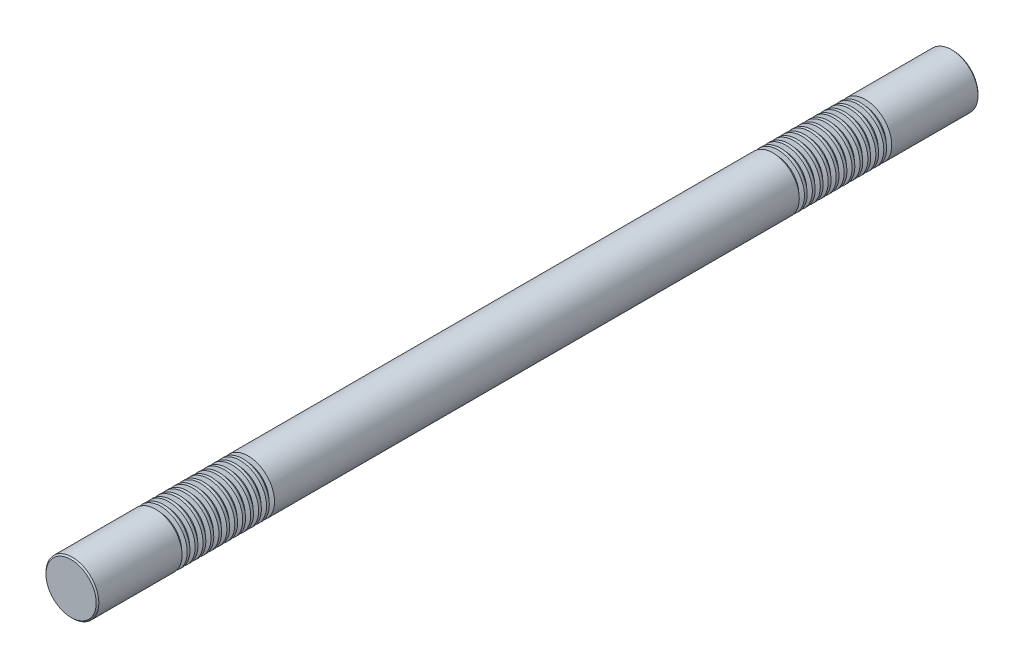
ISO-10303-21;
HEADER;
FILE_DESCRIPTION(('STEP AP214'),'2;1');
FILE_NAME('part.step','',(''),(''),'','','');
FILE_SCHEMA(('AUTOMOTIVE_DESIGN { 1 0 10303 214 1 1 1 1 }'));
ENDSEC;
DATA;
#1=APPLICATION_CONTEXT('core data for automotive mechanical design processes');
#2=APPLICATION_PROTOCOL_DEFINITION('international standard','automotive_design',2000,#1);
#3=PRODUCT_CONTEXT('',#1,'mechanical');
#4=PRODUCT('Part','Part','',(#3));
#5=PRODUCT_RELATED_PRODUCT_CATEGORY('part','',(#4));
#6=PRODUCT_DEFINITION_FORMATION('','',#4);
#7=PRODUCT_DEFINITION_CONTEXT('part definition',#1,'design');
#8=PRODUCT_DEFINITION('design','',#6,#7);
#9=PRODUCT_DEFINITION_SHAPE('','',#8);
#10=(LENGTH_UNIT() NAMED_UNIT(*) SI_UNIT(.MILLI.,.METRE.));
#11=(NAMED_UNIT(*) PLANE_ANGLE_UNIT() SI_UNIT($,.RADIAN.));
#12=(NAMED_UNIT(*) SI_UNIT($,.STERADIAN.) SOLID_ANGLE_UNIT());
#13=UNCERTAINTY_MEASURE_WITH_UNIT(LENGTH_MEASURE(1.E-05),#10,'distance_accuracy_value','');
#14=(GEOMETRIC_REPRESENTATION_CONTEXT(3) GLOBAL_UNCERTAINTY_ASSIGNED_CONTEXT((#13)) GLOBAL_UNIT_ASSIGNED_CONTEXT((#10,
#11,#12)) REPRESENTATION_CONTEXT('',''));
#15=CARTESIAN_POINT('',(0.,0.,0.));
#16=DIRECTION('',(0.,0.,1.));
#17=DIRECTION('',(1.,0.,0.));
#18=AXIS2_PLACEMENT_3D('',#15,#16,#17);
#19=CARTESIAN_POINT('',(0.,0.,500.));
#20=DIRECTION('',(0.,0.,-1.));
#21=DIRECTION('',(-1.,0.,0.));
#22=AXIS2_PLACEMENT_3D('',#19,#20,#21);
#23=CYLINDRICAL_SURFACE('',#22,30.);
#24=CARTESIAN_POINT('',(0.,0.,395.169872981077));
#25=DIRECTION('',(0.,0.,1.));
#26=DIRECTION('',(1.,0.,0.));
#27=AXIS2_PLACEMENT_3D('',#24,#25,#26);
#28=CIRCLE('',#27,30.);
#29=CARTESIAN_POINT('',(30.,0.,395.169872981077));
#30=VERTEX_POINT('',#29);
#31=EDGE_CURVE('E417',#30,#30,#28,.T.);
#32=ORIENTED_EDGE('',*,*,#31,.T.);
#33=EDGE_LOOP('',(#32));
#34=FACE_BOUND('',#33,.T.);
#35=CARTESIAN_POINT('',(0.,0.,398.330127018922));
#36=DIRECTION('',(0.,0.,1.));
#37=DIRECTION('',(1.,0.,0.));
#38=AXIS2_PLACEMENT_3D('',#35,#36,#37);
#39=CIRCLE('',#38,30.);
#40=CARTESIAN_POINT('',(30.,0.,398.330127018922));
#41=VERTEX_POINT('',#40);
#42=EDGE_CURVE('E429',#41,#41,#39,.T.);
#43=ORIENTED_EDGE('',*,*,#42,.F.);
#44=EDGE_LOOP('',(#43));
#45=FACE_BOUND('',#44,.T.);
#46=ADVANCED_FACE('F37',(#34,#45),#23,.T.);
#47=CARTESIAN_POINT('',(0.,0.,386.169872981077));
#48=DIRECTION('',(0.,0.,1.));
#49=DIRECTION('',(1.,0.,0.));
#50=AXIS2_PLACEMENT_3D('',#47,#48,#49);
#51=CIRCLE('',#50,30.);
#52=CARTESIAN_POINT('',(30.,0.,386.169872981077));
#53=VERTEX_POINT('',#52);
#54=EDGE_CURVE('E401',#53,#53,#51,.T.);
#55=ORIENTED_EDGE('',*,*,#54,.T.);
#56=EDGE_LOOP('',(#55));
#57=FACE_BOUND('',#56,.T.);
#58=CARTESIAN_POINT('',(0.,0.,389.330127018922));
#59=DIRECTION('',(0.,0.,1.));
#60=DIRECTION('',(1.,0.,0.));
#61=AXIS2_PLACEMENT_3D('',#58,#59,#60);
#62=CIRCLE('',#61,30.);
#63=CARTESIAN_POINT('',(30.,0.,389.330127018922));
#64=VERTEX_POINT('',#63);
#65=EDGE_CURVE('E413',#64,#64,#62,.T.);
#66=ORIENTED_EDGE('',*,*,#65,.F.);
#67=EDGE_LOOP('',(#66));
#68=FACE_BOUND('',#67,.T.);
#69=ADVANCED_FACE('F465',(#57,#68),#23,.T.);
#70=CARTESIAN_POINT('',(0.,0.,377.169872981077));
#71=DIRECTION('',(0.,0.,1.));
#72=DIRECTION('',(1.,0.,0.));
#73=AXIS2_PLACEMENT_3D('',#70,#71,#72);
#74=CIRCLE('',#73,30.);
#75=CARTESIAN_POINT('',(30.,0.,377.169872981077));
#76=VERTEX_POINT('',#75);
#77=EDGE_CURVE('E385',#76,#76,#74,.T.);
#78=ORIENTED_EDGE('',*,*,#77,.T.);
#79=EDGE_LOOP('',(#78));
#80=FACE_BOUND('',#79,.T.);
#81=CARTESIAN_POINT('',(0.,0.,380.330127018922));
#82=DIRECTION('',(0.,0.,1.));
#83=DIRECTION('',(1.,0.,0.));
#84=AXIS2_PLACEMENT_3D('',#81,#82,#83);
#85=CIRCLE('',#84,30.);
#86=CARTESIAN_POINT('',(30.,0.,380.330127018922));
#87=VERTEX_POINT('',#86);
#88=EDGE_CURVE('E397',#87,#87,#85,.T.);
#89=ORIENTED_EDGE('',*,*,#88,.F.);
#90=EDGE_LOOP('',(#89));
#91=FACE_BOUND('',#90,.T.);
#92=ADVANCED_FACE('F473',(#80,#91),#23,.T.);
#93=CARTESIAN_POINT('',(0.,0.,368.169872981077));
#94=DIRECTION('',(0.,0.,1.));
#95=DIRECTION('',(1.,0.,0.));
#96=AXIS2_PLACEMENT_3D('',#93,#94,#95);
#97=CIRCLE('',#96,30.);
#98=CARTESIAN_POINT('',(30.,0.,368.169872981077));
#99=VERTEX_POINT('',#98);
#100=EDGE_CURVE('E369',#99,#99,#97,.T.);
#101=ORIENTED_EDGE('',*,*,#100,.T.);
#102=EDGE_LOOP('',(#101));
#103=FACE_BOUND('',#102,.T.);
#104=CARTESIAN_POINT('',(0.,0.,371.330127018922));
#105=DIRECTION('',(0.,0.,1.));
#106=DIRECTION('',(1.,0.,0.));
#107=AXIS2_PLACEMENT_3D('',#104,#105,#106);
#108=CIRCLE('',#107,30.);
#109=CARTESIAN_POINT('',(30.,0.,371.330127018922));
#110=VERTEX_POINT('',#109);
#111=EDGE_CURVE('E381',#110,#110,#108,.T.);
#112=ORIENTED_EDGE('',*,*,#111,.F.);
#113=EDGE_LOOP('',(#112));
#114=FACE_BOUND('',#113,.T.);
#115=ADVANCED_FACE('F926',(#103,#114),#23,.T.);
#116=CARTESIAN_POINT('',(0.,0.,359.169872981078));
#117=DIRECTION('',(0.,0.,1.));
#118=DIRECTION('',(1.,0.,0.));
#119=AXIS2_PLACEMENT_3D('',#116,#117,#118);
#120=CIRCLE('',#119,30.);
#121=CARTESIAN_POINT('',(30.,0.,359.169872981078));
#122=VERTEX_POINT('',#121);
#123=EDGE_CURVE('E353',#122,#122,#120,.T.);
#124=ORIENTED_EDGE('',*,*,#123,.T.);
#125=EDGE_LOOP('',(#124));
#126=FACE_BOUND('',#125,.T.);
#127=CARTESIAN_POINT('',(0.,0.,362.330127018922));
#128=DIRECTION('',(0.,0.,1.));
#129=DIRECTION('',(1.,0.,0.));
#130=AXIS2_PLACEMENT_3D('',#127,#128,#129);
#131=CIRCLE('',#130,30.);
#132=CARTESIAN_POINT('',(30.,0.,362.330127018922));
#133=VERTEX_POINT('',#132);
#134=EDGE_CURVE('E365',#133,#133,#131,.T.);
#135=ORIENTED_EDGE('',*,*,#134,.F.);
#136=EDGE_LOOP('',(#135));
#137=FACE_BOUND('',#136,.T.);
#138=ADVANCED_FACE('F903',(#126,#137),#23,.T.);
#139=CARTESIAN_POINT('',(0.,0.,350.169872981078));
#140=DIRECTION('',(0.,0.,1.));
#141=DIRECTION('',(1.,0.,0.));
#142=AXIS2_PLACEMENT_3D('',#139,#140,#141);
#143=CIRCLE('',#142,30.);
#144=CARTESIAN_POINT('',(30.,0.,350.169872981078));
#145=VERTEX_POINT('',#144);
#146=EDGE_CURVE('E338',#145,#145,#143,.T.);
#147=ORIENTED_EDGE('',*,*,#146,.T.);
#148=EDGE_LOOP('',(#147));
#149=FACE_BOUND('',#148,.T.);
#150=CARTESIAN_POINT('',(0.,0.,353.330127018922));
#151=DIRECTION('',(0.,0.,1.));
#152=DIRECTION('',(1.,0.,0.));
#153=AXIS2_PLACEMENT_3D('',#150,#151,#152);
#154=CIRCLE('',#153,30.);
#155=CARTESIAN_POINT('',(30.,0.,353.330127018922));
#156=VERTEX_POINT('',#155);
#157=EDGE_CURVE('E349',#156,#156,#154,.T.);
#158=ORIENTED_EDGE('',*,*,#157,.F.);
#159=EDGE_LOOP('',(#158));
#160=FACE_BOUND('',#159,.T.);
#161=ADVANCED_FACE('F880',(#149,#160),#23,.T.);
#162=CARTESIAN_POINT('',(0.,0.,341.169872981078));
#163=DIRECTION('',(0.,0.,1.));
#164=DIRECTION('',(1.,0.,0.));
#165=AXIS2_PLACEMENT_3D('',#162,#163,#164);
#166=CIRCLE('',#165,30.);
#167=CARTESIAN_POINT('',(30.,0.,341.169872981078));
#168=VERTEX_POINT('',#167);
#169=EDGE_CURVE('E322',#168,#168,#166,.T.);
#170=ORIENTED_EDGE('',*,*,#169,.T.);
#171=EDGE_LOOP('',(#170));
#172=FACE_BOUND('',#171,.T.);
#173=CARTESIAN_POINT('',(0.,0.,344.330127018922));
#174=DIRECTION('',(0.,0.,1.));
#175=DIRECTION('',(1.,0.,0.));
#176=AXIS2_PLACEMENT_3D('',#173,#174,#175);
#177=CIRCLE('',#176,30.);
#178=CARTESIAN_POINT('',(30.,0.,344.330127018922));
#179=VERTEX_POINT('',#178);
#180=EDGE_CURVE('E334',#179,#179,#177,.T.);
#181=ORIENTED_EDGE('',*,*,#180,.F.);
#182=EDGE_LOOP('',(#181));
#183=FACE_BOUND('',#182,.T.);
#184=ADVANCED_FACE('F857',(#172,#183),#23,.T.);
#185=CARTESIAN_POINT('',(0.,0.,332.169872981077));
#186=DIRECTION('',(0.,0.,1.));
#187=DIRECTION('',(1.,0.,0.));
#188=AXIS2_PLACEMENT_3D('',#185,#186,#187);
#189=CIRCLE('',#188,30.);
#190=CARTESIAN_POINT('',(30.,0.,332.169872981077));
#191=VERTEX_POINT('',#190);
#192=EDGE_CURVE('E306',#191,#191,#189,.T.);
#193=ORIENTED_EDGE('',*,*,#192,.T.);
#194=EDGE_LOOP('',(#193));
#195=FACE_BOUND('',#194,.T.);
#196=CARTESIAN_POINT('',(0.,0.,335.330127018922));
#197=DIRECTION('',(0.,0.,1.));
#198=DIRECTION('',(1.,0.,0.));
#199=AXIS2_PLACEMENT_3D('',#196,#197,#198);
#200=CIRCLE('',#199,30.);
#201=CARTESIAN_POINT('',(30.,0.,335.330127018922));
#202=VERTEX_POINT('',#201);
#203=EDGE_CURVE('E318',#202,#202,#200,.T.);
#204=ORIENTED_EDGE('',*,*,#203,.F.);
#205=EDGE_LOOP('',(#204));
#206=FACE_BOUND('',#205,.T.);
#207=ADVANCED_FACE('F834',(#195,#206),#23,.T.);
#208=CARTESIAN_POINT('',(0.,0.,323.169872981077));
#209=DIRECTION('',(0.,0.,1.));
#210=DIRECTION('',(1.,0.,0.));
#211=AXIS2_PLACEMENT_3D('',#208,#209,#210);
#212=CIRCLE('',#211,30.);
#213=CARTESIAN_POINT('',(30.,0.,323.169872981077));
#214=VERTEX_POINT('',#213);
#215=EDGE_CURVE('E290',#214,#214,#212,.T.);
#216=ORIENTED_EDGE('',*,*,#215,.T.);
#217=EDGE_LOOP('',(#216));
#218=FACE_BOUND('',#217,.T.);
#219=CARTESIAN_POINT('',(0.,0.,326.330127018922));
#220=DIRECTION('',(0.,0.,1.));
#221=DIRECTION('',(1.,0.,0.));
#222=AXIS2_PLACEMENT_3D('',#219,#220,#221);
#223=CIRCLE('',#222,30.);
#224=CARTESIAN_POINT('',(30.,0.,326.330127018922));
#225=VERTEX_POINT('',#224);
#226=EDGE_CURVE('E302',#225,#225,#223,.T.);
#227=ORIENTED_EDGE('',*,*,#226,.F.);
#228=EDGE_LOOP('',(#227));
#229=FACE_BOUND('',#228,.T.);
#230=ADVANCED_FACE('F811',(#218,#229),#23,.T.);
#231=CARTESIAN_POINT('',(0.,0.,314.169872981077));
#232=DIRECTION('',(0.,0.,1.));
#233=DIRECTION('',(1.,0.,0.));
#234=AXIS2_PLACEMENT_3D('',#231,#232,#233);
#235=CIRCLE('',#234,30.);
#236=CARTESIAN_POINT('',(30.,0.,314.169872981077));
#237=VERTEX_POINT('',#236);
#238=EDGE_CURVE('E274',#237,#237,#235,.T.);
#239=ORIENTED_EDGE('',*,*,#238,.T.);
#240=EDGE_LOOP('',(#239));
#241=FACE_BOUND('',#240,.T.);
#242=CARTESIAN_POINT('',(0.,0.,317.330127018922));
#243=DIRECTION('',(0.,0.,1.));
#244=DIRECTION('',(1.,0.,0.));
#245=AXIS2_PLACEMENT_3D('',#242,#243,#244);
#246=CIRCLE('',#245,30.);
#247=CARTESIAN_POINT('',(30.,0.,317.330127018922));
#248=VERTEX_POINT('',#247);
#249=EDGE_CURVE('E286',#248,#248,#246,.T.);
#250=ORIENTED_EDGE('',*,*,#249,.F.);
#251=EDGE_LOOP('',(#250));
#252=FACE_BOUND('',#251,.T.);
#253=ADVANCED_FACE('F788',(#241,#252),#23,.T.);
#254=CARTESIAN_POINT('',(0.,0.,305.169872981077));
#255=DIRECTION('',(0.,0.,1.));
#256=DIRECTION('',(1.,0.,0.));
#257=AXIS2_PLACEMENT_3D('',#254,#255,#256);
#258=CIRCLE('',#257,30.);
#259=CARTESIAN_POINT('',(30.,0.,305.169872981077));
#260=VERTEX_POINT('',#259);
#261=EDGE_CURVE('E258',#260,#260,#258,.T.);
#262=ORIENTED_EDGE('',*,*,#261,.T.);
#263=EDGE_LOOP('',(#262));
#264=FACE_BOUND('',#263,.T.);
#265=CARTESIAN_POINT('',(0.,0.,308.330127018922));
#266=DIRECTION('',(0.,0.,1.));
#267=DIRECTION('',(1.,0.,0.));
#268=AXIS2_PLACEMENT_3D('',#265,#266,#267);
#269=CIRCLE('',#268,30.);
#270=CARTESIAN_POINT('',(30.,0.,308.330127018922));
#271=VERTEX_POINT('',#270);
#272=EDGE_CURVE('E270',#271,#271,#269,.T.);
#273=ORIENTED_EDGE('',*,*,#272,.F.);
#274=EDGE_LOOP('',(#273));
#275=FACE_BOUND('',#274,.T.);
#276=ADVANCED_FACE('F765',(#264,#275),#23,.T.);
#277=CARTESIAN_POINT('',(0.,0.,-295.830127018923));
#278=DIRECTION('',(0.,0.,1.));
#279=DIRECTION('',(1.,0.,0.));
#280=AXIS2_PLACEMENT_3D('',#277,#278,#279);
#281=CIRCLE('',#280,30.);
#282=CARTESIAN_POINT('',(30.,0.,-295.830127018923));
#283=VERTEX_POINT('',#282);
#284=EDGE_CURVE('E242',#283,#283,#281,.T.);
#285=ORIENTED_EDGE('',*,*,#284,.T.);
#286=EDGE_LOOP('',(#285));
#287=FACE_BOUND('',#286,.T.);
#288=CARTESIAN_POINT('',(0.,0.,299.330127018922));
#289=DIRECTION('',(0.,0.,1.));
#290=DIRECTION('',(1.,0.,0.));
#291=AXIS2_PLACEMENT_3D('',#288,#289,#290);
#292=CIRCLE('',#291,30.);
#293=CARTESIAN_POINT('',(30.,0.,299.330127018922));
#294=VERTEX_POINT('',#293);
#295=EDGE_CURVE('E254',#294,#294,#292,.T.);
#296=ORIENTED_EDGE('',*,*,#295,.F.);
#297=EDGE_LOOP('',(#296));
#298=FACE_BOUND('',#297,.T.);
#299=ADVANCED_FACE('F742',(#287,#298),#23,.T.);
#300=CARTESIAN_POINT('',(0.,0.,-304.830127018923));
#301=DIRECTION('',(0.,0.,1.));
#302=DIRECTION('',(1.,0.,0.));
#303=AXIS2_PLACEMENT_3D('',#300,#301,#302);
#304=CIRCLE('',#303,30.);
#305=CARTESIAN_POINT('',(30.,0.,-304.830127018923));
#306=VERTEX_POINT('',#305);
#307=EDGE_CURVE('E226',#306,#306,#304,.T.);
#308=ORIENTED_EDGE('',*,*,#307,.T.);
#309=EDGE_LOOP('',(#308));
#310=FACE_BOUND('',#309,.T.);
#311=CARTESIAN_POINT('',(0.,0.,-301.669872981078));
#312=DIRECTION('',(0.,0.,1.));
#313=DIRECTION('',(1.,0.,0.));
#314=AXIS2_PLACEMENT_3D('',#311,#312,#313);
#315=CIRCLE('',#314,30.);
#316=CARTESIAN_POINT('',(30.,0.,-301.669872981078));
#317=VERTEX_POINT('',#316);
#318=EDGE_CURVE('E238',#317,#317,#315,.T.);
#319=ORIENTED_EDGE('',*,*,#318,.F.);
#320=EDGE_LOOP('',(#319));
#321=FACE_BOUND('',#320,.T.);
#322=ADVANCED_FACE('F719',(#310,#321),#23,.T.);
#323=CARTESIAN_POINT('',(0.,0.,-313.830127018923));
#324=DIRECTION('',(0.,0.,1.));
#325=DIRECTION('',(1.,0.,0.));
#326=AXIS2_PLACEMENT_3D('',#323,#324,#325);
#327=CIRCLE('',#326,30.);
#328=CARTESIAN_POINT('',(30.,0.,-313.830127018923));
#329=VERTEX_POINT('',#328);
#330=EDGE_CURVE('E210',#329,#329,#327,.T.);
#331=ORIENTED_EDGE('',*,*,#330,.T.);
#332=EDGE_LOOP('',(#331));
#333=FACE_BOUND('',#332,.T.);
#334=CARTESIAN_POINT('',(0.,0.,-310.669872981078));
#335=DIRECTION('',(0.,0.,1.));
#336=DIRECTION('',(1.,0.,0.));
#337=AXIS2_PLACEMENT_3D('',#334,#335,#336);
#338=CIRCLE('',#337,30.);
#339=CARTESIAN_POINT('',(30.,0.,-310.669872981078));
#340=VERTEX_POINT('',#339);
#341=EDGE_CURVE('E222',#340,#340,#338,.T.);
#342=ORIENTED_EDGE('',*,*,#341,.F.);
#343=EDGE_LOOP('',(#342));
#344=FACE_BOUND('',#343,.T.);
#345=ADVANCED_FACE('F696',(#333,#344),#23,.T.);
#346=CARTESIAN_POINT('',(0.,0.,-322.830127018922));
#347=DIRECTION('',(0.,0.,1.));
#348=DIRECTION('',(1.,0.,0.));
#349=AXIS2_PLACEMENT_3D('',#346,#347,#348);
#350=CIRCLE('',#349,30.);
#351=CARTESIAN_POINT('',(30.,0.,-322.830127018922));
#352=VERTEX_POINT('',#351);
#353=EDGE_CURVE('E194',#352,#352,#350,.T.);
#354=ORIENTED_EDGE('',*,*,#353,.T.);
#355=EDGE_LOOP('',(#354));
#356=FACE_BOUND('',#355,.T.);
#357=CARTESIAN_POINT('',(0.,0.,-319.669872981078));
#358=DIRECTION('',(0.,0.,1.));
#359=DIRECTION('',(1.,0.,0.));
#360=AXIS2_PLACEMENT_3D('',#357,#358,#359);
#361=CIRCLE('',#360,30.);
#362=CARTESIAN_POINT('',(30.,0.,-319.669872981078));
#363=VERTEX_POINT('',#362);
#364=EDGE_CURVE('E206',#363,#363,#361,.T.);
#365=ORIENTED_EDGE('',*,*,#364,.F.);
#366=EDGE_LOOP('',(#365));
#367=FACE_BOUND('',#366,.T.);
#368=ADVANCED_FACE('F673',(#356,#367),#23,.T.);
#369=CARTESIAN_POINT('',(0.,0.,-331.830127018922));
#370=DIRECTION('',(0.,0.,1.));
#371=DIRECTION('',(1.,0.,0.));
#372=AXIS2_PLACEMENT_3D('',#369,#370,#371);
#373=CIRCLE('',#372,30.);
#374=CARTESIAN_POINT('',(30.,0.,-331.830127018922));
#375=VERTEX_POINT('',#374);
#376=EDGE_CURVE('E178',#375,#375,#373,.T.);
#377=ORIENTED_EDGE('',*,*,#376,.T.);
#378=EDGE_LOOP('',(#377));
#379=FACE_BOUND('',#378,.T.);
#380=CARTESIAN_POINT('',(0.,0.,-328.669872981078));
#381=DIRECTION('',(0.,0.,1.));
#382=DIRECTION('',(1.,0.,0.));
#383=AXIS2_PLACEMENT_3D('',#380,#381,#382);
#384=CIRCLE('',#383,30.);
#385=CARTESIAN_POINT('',(30.,0.,-328.669872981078));
#386=VERTEX_POINT('',#385);
#387=EDGE_CURVE('E190',#386,#386,#384,.T.);
#388=ORIENTED_EDGE('',*,*,#387,.F.);
#389=EDGE_LOOP('',(#388));
#390=FACE_BOUND('',#389,.T.);
#391=ADVANCED_FACE('F650',(#379,#390),#23,.T.);
#392=CARTESIAN_POINT('',(0.,0.,-340.830127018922));
#393=DIRECTION('',(0.,0.,1.));
#394=DIRECTION('',(1.,0.,0.));
#395=AXIS2_PLACEMENT_3D('',#392,#393,#394);
#396=CIRCLE('',#395,30.);
#397=CARTESIAN_POINT('',(30.,0.,-340.830127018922));
#398=VERTEX_POINT('',#397);
#399=EDGE_CURVE('E163',#398,#398,#396,.T.);
#400=ORIENTED_EDGE('',*,*,#399,.T.);
#401=EDGE_LOOP('',(#400));
#402=FACE_BOUND('',#401,.T.);
#403=CARTESIAN_POINT('',(0.,0.,-337.669872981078));
#404=DIRECTION('',(0.,0.,1.));
#405=DIRECTION('',(1.,0.,0.));
#406=AXIS2_PLACEMENT_3D('',#403,#404,#405);
#407=CIRCLE('',#406,30.);
#408=CARTESIAN_POINT('',(30.,0.,-337.669872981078));
#409=VERTEX_POINT('',#408);
#410=EDGE_CURVE('E174',#409,#409,#407,.T.);
#411=ORIENTED_EDGE('',*,*,#410,.F.);
#412=EDGE_LOOP('',(#411));
#413=FACE_BOUND('',#412,.T.);
#414=ADVANCED_FACE('F627',(#402,#413),#23,.T.);
#415=CARTESIAN_POINT('',(0.,0.,-349.830127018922));
#416=DIRECTION('',(0.,0.,1.));
#417=DIRECTION('',(1.,0.,0.));
#418=AXIS2_PLACEMENT_3D('',#415,#416,#417);
#419=CIRCLE('',#418,30.);
#420=CARTESIAN_POINT('',(30.,0.,-349.830127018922));
#421=VERTEX_POINT('',#420);
#422=EDGE_CURVE('E147',#421,#421,#419,.T.);
#423=ORIENTED_EDGE('',*,*,#422,.T.);
#424=EDGE_LOOP('',(#423));
#425=FACE_BOUND('',#424,.T.);
#426=CARTESIAN_POINT('',(0.,0.,-346.669872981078));
#427=DIRECTION('',(0.,0.,1.));
#428=DIRECTION('',(1.,0.,0.));
#429=AXIS2_PLACEMENT_3D('',#426,#427,#428);
#430=CIRCLE('',#429,30.);
#431=CARTESIAN_POINT('',(30.,0.,-346.669872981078));
#432=VERTEX_POINT('',#431);
#433=EDGE_CURVE('E159',#432,#432,#430,.T.);
#434=ORIENTED_EDGE('',*,*,#433,.F.);
#435=EDGE_LOOP('',(#434));
#436=FACE_BOUND('',#435,.T.);
#437=ADVANCED_FACE('F604',(#425,#436),#23,.T.);
#438=CARTESIAN_POINT('',(0.,0.,-358.830127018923));
#439=DIRECTION('',(0.,0.,1.));
#440=DIRECTION('',(1.,0.,0.));
#441=AXIS2_PLACEMENT_3D('',#438,#439,#440);
#442=CIRCLE('',#441,30.);
#443=CARTESIAN_POINT('',(30.,0.,-358.830127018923));
#444=VERTEX_POINT('',#443);
#445=EDGE_CURVE('E131',#444,#444,#442,.T.);
#446=ORIENTED_EDGE('',*,*,#445,.T.);
#447=EDGE_LOOP('',(#446));
#448=FACE_BOUND('',#447,.T.);
#449=CARTESIAN_POINT('',(0.,0.,-355.669872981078));
#450=DIRECTION('',(0.,0.,1.));
#451=DIRECTION('',(1.,0.,0.));
#452=AXIS2_PLACEMENT_3D('',#449,#450,#451);
#453=CIRCLE('',#452,30.);
#454=CARTESIAN_POINT('',(30.,0.,-355.669872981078));
#455=VERTEX_POINT('',#454);
#456=EDGE_CURVE('E143',#455,#455,#453,.T.);
#457=ORIENTED_EDGE('',*,*,#456,.F.);
#458=EDGE_LOOP('',(#457));
#459=FACE_BOUND('',#458,.T.);
#460=ADVANCED_FACE('F581',(#448,#459),#23,.T.);
#461=CARTESIAN_POINT('',(0.,0.,-367.830127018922));
#462=DIRECTION('',(0.,0.,1.));
#463=DIRECTION('',(1.,0.,0.));
#464=AXIS2_PLACEMENT_3D('',#461,#462,#463);
#465=CIRCLE('',#464,30.);
#466=CARTESIAN_POINT('',(30.,0.,-367.830127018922));
#467=VERTEX_POINT('',#466);
#468=EDGE_CURVE('E115',#467,#467,#465,.T.);
#469=ORIENTED_EDGE('',*,*,#468,.T.);
#470=EDGE_LOOP('',(#469));
#471=FACE_BOUND('',#470,.T.);
#472=CARTESIAN_POINT('',(0.,0.,-364.669872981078));
#473=DIRECTION('',(0.,0.,1.));
#474=DIRECTION('',(1.,0.,0.));
#475=AXIS2_PLACEMENT_3D('',#472,#473,#474);
#476=CIRCLE('',#475,30.);
#477=CARTESIAN_POINT('',(30.,0.,-364.669872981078));
#478=VERTEX_POINT('',#477);
#479=EDGE_CURVE('E127',#478,#478,#476,.T.);
#480=ORIENTED_EDGE('',*,*,#479,.F.);
#481=EDGE_LOOP('',(#480));
#482=FACE_BOUND('',#481,.T.);
#483=ADVANCED_FACE('F558',(#471,#482),#23,.T.);
#484=CARTESIAN_POINT('',(0.,0.,-376.830127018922));
#485=DIRECTION('',(0.,0.,1.));
#486=DIRECTION('',(1.,0.,0.));
#487=AXIS2_PLACEMENT_3D('',#484,#485,#486);
#488=CIRCLE('',#487,30.);
#489=CARTESIAN_POINT('',(30.,0.,-376.830127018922));
#490=VERTEX_POINT('',#489);
#491=EDGE_CURVE('E100',#490,#490,#488,.T.);
#492=ORIENTED_EDGE('',*,*,#491,.T.);
#493=EDGE_LOOP('',(#492));
#494=FACE_BOUND('',#493,.T.);
#495=CARTESIAN_POINT('',(0.,0.,-373.669872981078));
#496=DIRECTION('',(0.,0.,1.));
#497=DIRECTION('',(1.,0.,0.));
#498=AXIS2_PLACEMENT_3D('',#495,#496,#497);
#499=CIRCLE('',#498,30.);
#500=CARTESIAN_POINT('',(30.,0.,-373.669872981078));
#501=VERTEX_POINT('',#500);
#502=EDGE_CURVE('E112',#501,#501,#499,.T.);
#503=ORIENTED_EDGE('',*,*,#502,.F.);
#504=EDGE_LOOP('',(#503));
#505=FACE_BOUND('',#504,.T.);
#506=ADVANCED_FACE('F535',(#494,#505),#23,.T.);
#507=CARTESIAN_POINT('',(0.,0.,-385.830127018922));
#508=DIRECTION('',(0.,0.,1.));
#509=DIRECTION('',(1.,0.,0.));
#510=AXIS2_PLACEMENT_3D('',#507,#508,#509);
#511=CIRCLE('',#510,30.);
#512=CARTESIAN_POINT('',(30.,0.,-385.830127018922));
#513=VERTEX_POINT('',#512);
#514=EDGE_CURVE('E84',#513,#513,#511,.T.);
#515=ORIENTED_EDGE('',*,*,#514,.T.);
#516=EDGE_LOOP('',(#515));
#517=FACE_BOUND('',#516,.T.);
#518=CARTESIAN_POINT('',(0.,0.,-382.669872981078));
#519=DIRECTION('',(0.,0.,1.));
#520=DIRECTION('',(1.,0.,0.));
#521=AXIS2_PLACEMENT_3D('',#518,#519,#520);
#522=CIRCLE('',#521,30.);
#523=CARTESIAN_POINT('',(30.,0.,-382.669872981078));
#524=VERTEX_POINT('',#523);
#525=EDGE_CURVE('E96',#524,#524,#522,.T.);
#526=ORIENTED_EDGE('',*,*,#525,.F.);
#527=EDGE_LOOP('',(#526));
#528=FACE_BOUND('',#527,.T.);
#529=ADVANCED_FACE('F488',(#517,#528),#23,.T.);
#530=CARTESIAN_POINT('',(0.,0.,-394.830127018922));
#531=DIRECTION('',(0.,0.,1.));
#532=DIRECTION('',(1.,0.,0.));
#533=AXIS2_PLACEMENT_3D('',#530,#531,#532);
#534=CIRCLE('',#533,30.);
#535=CARTESIAN_POINT('',(30.,0.,-394.830127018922));
#536=VERTEX_POINT('',#535);
#537=EDGE_CURVE('E69',#536,#536,#534,.T.);
#538=ORIENTED_EDGE('',*,*,#537,.T.);
#539=EDGE_LOOP('',(#538));
#540=FACE_BOUND('',#539,.T.);
#541=CARTESIAN_POINT('',(0.,0.,-391.669872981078));
#542=DIRECTION('',(0.,0.,1.));
#543=DIRECTION('',(1.,0.,0.));
#544=AXIS2_PLACEMENT_3D('',#541,#542,#543);
#545=CIRCLE('',#544,30.);
#546=CARTESIAN_POINT('',(30.,0.,-391.669872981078));
#547=VERTEX_POINT('',#546);
#548=EDGE_CURVE('E81',#547,#547,#545,.T.);
#549=ORIENTED_EDGE('',*,*,#548,.F.);
#550=EDGE_LOOP('',(#549));
#551=FACE_BOUND('',#550,.T.);
#552=ADVANCED_FACE('F481',(#540,#551),#23,.T.);
#553=CARTESIAN_POINT('',(0.,0.,-498.5));
#554=DIRECTION('',(0.,0.,1.));
#555=DIRECTION('',(1.,0.,0.));
#556=AXIS2_PLACEMENT_3D('',#553,#554,#555);
#557=CIRCLE('',#556,30.);
#558=CARTESIAN_POINT('',(30.,0.,-498.5));
#559=VERTEX_POINT('',#558);
#560=EDGE_CURVE('E52',#559,#559,#557,.T.);
#561=ORIENTED_EDGE('',*,*,#560,.T.);
#562=EDGE_LOOP('',(#561));
#563=FACE_BOUND('',#562,.T.);
#564=CARTESIAN_POINT('',(0.,0.,-400.669872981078));
#565=DIRECTION('',(0.,0.,1.));
#566=DIRECTION('',(1.,0.,0.));
#567=AXIS2_PLACEMENT_3D('',#564,#565,#566);
#568=CIRCLE('',#567,30.);
#569=CARTESIAN_POINT('',(30.,0.,-400.669872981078));
#570=VERTEX_POINT('',#569);
#571=EDGE_CURVE('E65',#570,#570,#568,.T.);
#572=ORIENTED_EDGE('',*,*,#571,.F.);
#573=EDGE_LOOP('',(#572));
#574=FACE_BOUND('',#573,.T.);
#575=ADVANCED_FACE('F469',(#563,#574),#23,.T.);
#576=CARTESIAN_POINT('',(0.,0.,-500.));
#577=DIRECTION('',(0.,0.,1.));
#578=DIRECTION('',(1.,0.,0.));
#579=AXIS2_PLACEMENT_3D('',#576,#577,#578);
#580=PLANE('',#579);
#581=CARTESIAN_POINT('',(0.,0.,-500.));
#582=DIRECTION('',(0.,0.,1.));
#583=DIRECTION('',(1.,0.,0.));
#584=AXIS2_PLACEMENT_3D('',#581,#582,#583);
#585=CIRCLE('',#584,28.5000000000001);
#586=CARTESIAN_POINT('',(28.5000000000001,0.,-500.));
#587=VERTEX_POINT('',#586);
#588=EDGE_CURVE('E45',#587,#587,#585,.F.);
#589=ORIENTED_EDGE('',*,*,#588,.T.);
#590=EDGE_LOOP('',(#589));
#591=FACE_BOUND('',#590,.T.);
#592=ADVANCED_FACE('F480',(#591),#580,.F.);
#593=CARTESIAN_POINT('',(0.,0.,-498.5));
#594=DIRECTION('',(0.,0.,1.));
#595=DIRECTION('',(1.,0.,0.));
#596=AXIS2_PLACEMENT_3D('',#593,#594,#595);
#597=CONICAL_SURFACE('',#596,30.,0.785398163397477);
#598=ORIENTED_EDGE('',*,*,#588,.F.);
#599=EDGE_LOOP('',(#598));
#600=FACE_BOUND('',#599,.T.);
#601=ORIENTED_EDGE('',*,*,#560,.F.);
#602=EDGE_LOOP('',(#601));
#603=FACE_BOUND('',#602,.T.);
#604=ADVANCED_FACE('F487',(#600,#603),#597,.T.);
#605=CARTESIAN_POINT('',(0.,0.,-399.330127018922));
#606=DIRECTION('',(0.,0.,-1.));
#607=DIRECTION('',(-1.,0.,0.));
#608=AXIS2_PLACEMENT_3D('',#605,#606,#607);
#609=CONICAL_SURFACE('',#608,25.,1.30899693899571);
#610=ORIENTED_EDGE('',*,*,#571,.T.);
#611=EDGE_LOOP('',(#610));
#612=FACE_BOUND('',#611,.T.);
#613=CARTESIAN_POINT('',(0.,0.,-399.330127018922));
#614=DIRECTION('',(0.,0.,1.));
#615=DIRECTION('',(1.,0.,0.));
#616=AXIS2_PLACEMENT_3D('',#613,#614,#615);
#617=CIRCLE('',#616,25.);
#618=CARTESIAN_POINT('',(25.,0.,-399.330127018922));
#619=VERTEX_POINT('',#618);
#620=EDGE_CURVE('E77',#619,#619,#617,.T.);
#621=ORIENTED_EDGE('',*,*,#620,.F.);
#622=EDGE_LOOP('',(#621));
#623=FACE_BOUND('',#622,.T.);
#624=ADVANCED_FACE('F494',(#612,#623),#609,.T.);
#625=CARTESIAN_POINT('',(0.,0.,-394.830127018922));
#626=DIRECTION('',(0.,0.,1.));
#627=DIRECTION('',(1.,0.,0.));
#628=AXIS2_PLACEMENT_3D('',#625,#626,#627);
#629=CONICAL_SURFACE('',#628,30.,1.30899693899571);
#630=CARTESIAN_POINT('',(0.,0.,-396.169872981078));
#631=DIRECTION('',(0.,0.,1.));
#632=DIRECTION('',(1.,0.,0.));
#633=AXIS2_PLACEMENT_3D('',#630,#631,#632);
#634=CIRCLE('',#633,25.);
#635=CARTESIAN_POINT('',(25.,0.,-396.169872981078));
#636=VERTEX_POINT('',#635);
#637=EDGE_CURVE('E73',#636,#636,#634,.T.);
#638=ORIENTED_EDGE('',*,*,#637,.T.);
#639=EDGE_LOOP('',(#638));
#640=FACE_BOUND('',#639,.T.);
#641=ORIENTED_EDGE('',*,*,#537,.F.);
#642=EDGE_LOOP('',(#641));
#643=FACE_BOUND('',#642,.T.);
#644=ADVANCED_FACE('F497',(#640,#643),#629,.T.);
#645=CARTESIAN_POINT('',(0.,0.,498.5));
#646=DIRECTION('',(0.,0.,1.));
#647=DIRECTION('',(1.,0.,0.));
#648=AXIS2_PLACEMENT_3D('',#645,#646,#647);
#649=CYLINDRICAL_SURFACE('',#648,25.);
#650=ORIENTED_EDGE('',*,*,#620,.T.);
#651=EDGE_LOOP('',(#650));
#652=FACE_BOUND('',#651,.T.);
#653=ORIENTED_EDGE('',*,*,#637,.F.);
#654=EDGE_LOOP('',(#653));
#655=FACE_BOUND('',#654,.T.);
#656=ADVANCED_FACE('F501',(#652,#655),#649,.T.);
#657=CARTESIAN_POINT('',(0.,0.,-390.330127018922));
#658=DIRECTION('',(0.,0.,-1.));
#659=DIRECTION('',(-1.,0.,0.));
#660=AXIS2_PLACEMENT_3D('',#657,#658,#659);
#661=CONICAL_SURFACE('',#660,25.,1.30899693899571);
#662=ORIENTED_EDGE('',*,*,#548,.T.);
#663=EDGE_LOOP('',(#662));
#664=FACE_BOUND('',#663,.T.);
#665=CARTESIAN_POINT('',(0.,0.,-390.330127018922));
#666=DIRECTION('',(0.,0.,1.));
#667=DIRECTION('',(1.,0.,0.));
#668=AXIS2_PLACEMENT_3D('',#665,#666,#667);
#669=CIRCLE('',#668,25.);
#670=CARTESIAN_POINT('',(25.,0.,-390.330127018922));
#671=VERTEX_POINT('',#670);
#672=EDGE_CURVE('E92',#671,#671,#669,.T.);
#673=ORIENTED_EDGE('',*,*,#672,.F.);
#674=EDGE_LOOP('',(#673));
#675=FACE_BOUND('',#674,.T.);
#676=ADVANCED_FACE('F504',(#664,#675),#661,.T.);
#677=CARTESIAN_POINT('',(0.,0.,-385.830127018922));
#678=DIRECTION('',(0.,0.,1.));
#679=DIRECTION('',(1.,0.,0.));
#680=AXIS2_PLACEMENT_3D('',#677,#678,#679);
#681=CONICAL_SURFACE('',#680,30.,1.30899693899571);
#682=CARTESIAN_POINT('',(0.,0.,-387.169872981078));
#683=DIRECTION('',(0.,0.,1.));
#684=DIRECTION('',(1.,0.,0.));
#685=AXIS2_PLACEMENT_3D('',#682,#683,#684);
#686=CIRCLE('',#685,25.);
#687=CARTESIAN_POINT('',(25.,0.,-387.169872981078));
#688=VERTEX_POINT('',#687);
#689=EDGE_CURVE('E88',#688,#688,#686,.T.);
#690=ORIENTED_EDGE('',*,*,#689,.T.);
#691=EDGE_LOOP('',(#690));
#692=FACE_BOUND('',#691,.T.);
#693=ORIENTED_EDGE('',*,*,#514,.F.);
#694=EDGE_LOOP('',(#693));
#695=FACE_BOUND('',#694,.T.);
#696=ADVANCED_FACE('F517',(#692,#695),#681,.T.);
#697=CARTESIAN_POINT('',(0.,0.,-391.669872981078));
#698=DIRECTION('',(0.,0.,1.));
#699=DIRECTION('',(1.,0.,0.));
#700=AXIS2_PLACEMENT_3D('',#697,#698,#699);
#701=CYLINDRICAL_SURFACE('',#700,25.);
#702=ORIENTED_EDGE('',*,*,#672,.T.);
#703=EDGE_LOOP('',(#702));
#704=FACE_BOUND('',#703,.T.);
#705=ORIENTED_EDGE('',*,*,#689,.F.);
#706=EDGE_LOOP('',(#705));
#707=FACE_BOUND('',#706,.T.);
#708=ADVANCED_FACE('F521',(#704,#707),#701,.T.);
#709=CARTESIAN_POINT('',(0.,0.,-381.330127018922));
#710=DIRECTION('',(0.,0.,-1.));
#711=DIRECTION('',(-1.,0.,0.));
#712=AXIS2_PLACEMENT_3D('',#709,#710,#711);
#713=CONICAL_SURFACE('',#712,25.,1.30899693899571);
#714=ORIENTED_EDGE('',*,*,#525,.T.);
#715=EDGE_LOOP('',(#714));
#716=FACE_BOUND('',#715,.T.);
#717=CARTESIAN_POINT('',(0.,0.,-381.330127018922));
#718=DIRECTION('',(0.,0.,1.));
#719=DIRECTION('',(1.,0.,0.));
#720=AXIS2_PLACEMENT_3D('',#717,#718,#719);
#721=CIRCLE('',#720,25.);
#722=CARTESIAN_POINT('',(25.,0.,-381.330127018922));
#723=VERTEX_POINT('',#722);
#724=EDGE_CURVE('E108',#723,#723,#721,.T.);
#725=ORIENTED_EDGE('',*,*,#724,.F.);
#726=EDGE_LOOP('',(#725));
#727=FACE_BOUND('',#726,.T.);
#728=ADVANCED_FACE('F524',(#716,#727),#713,.T.);
#729=CARTESIAN_POINT('',(0.,0.,-376.830127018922));
#730=DIRECTION('',(0.,0.,1.));
#731=DIRECTION('',(1.,0.,0.));
#732=AXIS2_PLACEMENT_3D('',#729,#730,#731);
#733=CONICAL_SURFACE('',#732,30.,1.30899693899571);
#734=CARTESIAN_POINT('',(0.,0.,-378.169872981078));
#735=DIRECTION('',(0.,0.,1.));
#736=DIRECTION('',(1.,0.,0.));
#737=AXIS2_PLACEMENT_3D('',#734,#735,#736);
#738=CIRCLE('',#737,25.);
#739=CARTESIAN_POINT('',(25.,0.,-378.169872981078));
#740=VERTEX_POINT('',#739);
#741=EDGE_CURVE('E104',#740,#740,#738,.T.);
#742=ORIENTED_EDGE('',*,*,#741,.T.);
#743=EDGE_LOOP('',(#742));
#744=FACE_BOUND('',#743,.T.);
#745=ORIENTED_EDGE('',*,*,#491,.F.);
#746=EDGE_LOOP('',(#745));
#747=FACE_BOUND('',#746,.T.);
#748=ADVANCED_FACE('F540',(#744,#747),#733,.T.);
#749=CARTESIAN_POINT('',(0.,0.,-382.669872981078));
#750=DIRECTION('',(0.,0.,1.));
#751=DIRECTION('',(1.,0.,0.));
#752=AXIS2_PLACEMENT_3D('',#749,#750,#751);
#753=CYLINDRICAL_SURFACE('',#752,25.);
#754=ORIENTED_EDGE('',*,*,#724,.T.);
#755=EDGE_LOOP('',(#754));
#756=FACE_BOUND('',#755,.T.);
#757=ORIENTED_EDGE('',*,*,#741,.F.);
#758=EDGE_LOOP('',(#757));
#759=FACE_BOUND('',#758,.T.);
#760=ADVANCED_FACE('F544',(#756,#759),#753,.T.);
#761=CARTESIAN_POINT('',(0.,0.,-372.330127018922));
#762=DIRECTION('',(0.,0.,-1.));
#763=DIRECTION('',(-1.,0.,0.));
#764=AXIS2_PLACEMENT_3D('',#761,#762,#763);
#765=CONICAL_SURFACE('',#764,25.,1.30899693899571);
#766=ORIENTED_EDGE('',*,*,#502,.T.);
#767=EDGE_LOOP('',(#766));
#768=FACE_BOUND('',#767,.T.);
#769=CARTESIAN_POINT('',(0.,0.,-372.330127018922));
#770=DIRECTION('',(0.,0.,1.));
#771=DIRECTION('',(1.,0.,0.));
#772=AXIS2_PLACEMENT_3D('',#769,#770,#771);
#773=CIRCLE('',#772,25.);
#774=CARTESIAN_POINT('',(25.,0.,-372.330127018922));
#775=VERTEX_POINT('',#774);
#776=EDGE_CURVE('E123',#775,#775,#773,.T.);
#777=ORIENTED_EDGE('',*,*,#776,.F.);
#778=EDGE_LOOP('',(#777));
#779=FACE_BOUND('',#778,.T.);
#780=ADVANCED_FACE('F547',(#768,#779),#765,.T.);
#781=CARTESIAN_POINT('',(0.,0.,-367.830127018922));
#782=DIRECTION('',(0.,0.,1.));
#783=DIRECTION('',(1.,0.,0.));
#784=AXIS2_PLACEMENT_3D('',#781,#782,#783);
#785=CONICAL_SURFACE('',#784,30.,1.30899693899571);
#786=CARTESIAN_POINT('',(0.,0.,-369.169872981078));
#787=DIRECTION('',(0.,0.,1.));
#788=DIRECTION('',(1.,0.,0.));
#789=AXIS2_PLACEMENT_3D('',#786,#787,#788);
#790=CIRCLE('',#789,25.);
#791=CARTESIAN_POINT('',(25.,0.,-369.169872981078));
#792=VERTEX_POINT('',#791);
#793=EDGE_CURVE('E119',#792,#792,#790,.T.);
#794=ORIENTED_EDGE('',*,*,#793,.T.);
#795=EDGE_LOOP('',(#794));
#796=FACE_BOUND('',#795,.T.);
#797=ORIENTED_EDGE('',*,*,#468,.F.);
#798=EDGE_LOOP('',(#797));
#799=FACE_BOUND('',#798,.T.);
#800=ADVANCED_FACE('F563',(#796,#799),#785,.T.);
#801=CARTESIAN_POINT('',(0.,0.,-373.669872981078));
#802=DIRECTION('',(0.,0.,1.));
#803=DIRECTION('',(1.,0.,0.));
#804=AXIS2_PLACEMENT_3D('',#801,#802,#803);
#805=CYLINDRICAL_SURFACE('',#804,25.);
#806=ORIENTED_EDGE('',*,*,#776,.T.);
#807=EDGE_LOOP('',(#806));
#808=FACE_BOUND('',#807,.T.);
#809=ORIENTED_EDGE('',*,*,#793,.F.);
#810=EDGE_LOOP('',(#809));
#811=FACE_BOUND('',#810,.T.);
#812=ADVANCED_FACE('F567',(#808,#811),#805,.T.);
#813=CARTESIAN_POINT('',(0.,0.,-363.330127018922));
#814=DIRECTION('',(0.,0.,-1.));
#815=DIRECTION('',(-1.,0.,0.));
#816=AXIS2_PLACEMENT_3D('',#813,#814,#815);
#817=CONICAL_SURFACE('',#816,25.,1.30899693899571);
#818=ORIENTED_EDGE('',*,*,#479,.T.);
#819=EDGE_LOOP('',(#818));
#820=FACE_BOUND('',#819,.T.);
#821=CARTESIAN_POINT('',(0.,0.,-363.330127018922));
#822=DIRECTION('',(0.,0.,1.));
#823=DIRECTION('',(1.,0.,0.));
#824=AXIS2_PLACEMENT_3D('',#821,#822,#823);
#825=CIRCLE('',#824,25.);
#826=CARTESIAN_POINT('',(25.,0.,-363.330127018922));
#827=VERTEX_POINT('',#826);
#828=EDGE_CURVE('E139',#827,#827,#825,.T.);
#829=ORIENTED_EDGE('',*,*,#828,.F.);
#830=EDGE_LOOP('',(#829));
#831=FACE_BOUND('',#830,.T.);
#832=ADVANCED_FACE('F570',(#820,#831),#817,.T.);
#833=CARTESIAN_POINT('',(0.,0.,-358.830127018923));
#834=DIRECTION('',(0.,0.,1.));
#835=DIRECTION('',(1.,0.,0.));
#836=AXIS2_PLACEMENT_3D('',#833,#834,#835);
#837=CONICAL_SURFACE('',#836,30.,1.30899693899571);
#838=CARTESIAN_POINT('',(0.,0.,-360.169872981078));
#839=DIRECTION('',(0.,0.,1.));
#840=DIRECTION('',(1.,0.,0.));
#841=AXIS2_PLACEMENT_3D('',#838,#839,#840);
#842=CIRCLE('',#841,25.);
#843=CARTESIAN_POINT('',(25.,0.,-360.169872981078));
#844=VERTEX_POINT('',#843);
#845=EDGE_CURVE('E135',#844,#844,#842,.T.);
#846=ORIENTED_EDGE('',*,*,#845,.T.);
#847=EDGE_LOOP('',(#846));
#848=FACE_BOUND('',#847,.T.);
#849=ORIENTED_EDGE('',*,*,#445,.F.);
#850=EDGE_LOOP('',(#849));
#851=FACE_BOUND('',#850,.T.);
#852=ADVANCED_FACE('F586',(#848,#851),#837,.T.);
#853=CARTESIAN_POINT('',(0.,0.,-364.669872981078));
#854=DIRECTION('',(0.,0.,1.));
#855=DIRECTION('',(1.,0.,0.));
#856=AXIS2_PLACEMENT_3D('',#853,#854,#855);
#857=CYLINDRICAL_SURFACE('',#856,25.);
#858=ORIENTED_EDGE('',*,*,#828,.T.);
#859=EDGE_LOOP('',(#858));
#860=FACE_BOUND('',#859,.T.);
#861=ORIENTED_EDGE('',*,*,#845,.F.);
#862=EDGE_LOOP('',(#861));
#863=FACE_BOUND('',#862,.T.);
#864=ADVANCED_FACE('F590',(#860,#863),#857,.T.);
#865=CARTESIAN_POINT('',(0.,0.,-354.330127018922));
#866=DIRECTION('',(0.,0.,-1.));
#867=DIRECTION('',(-1.,0.,0.));
#868=AXIS2_PLACEMENT_3D('',#865,#866,#867);
#869=CONICAL_SURFACE('',#868,25.,1.30899693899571);
#870=ORIENTED_EDGE('',*,*,#456,.T.);
#871=EDGE_LOOP('',(#870));
#872=FACE_BOUND('',#871,.T.);
#873=CARTESIAN_POINT('',(0.,0.,-354.330127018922));
#874=DIRECTION('',(0.,0.,1.));
#875=DIRECTION('',(1.,0.,0.));
#876=AXIS2_PLACEMENT_3D('',#873,#874,#875);
#877=CIRCLE('',#876,25.);
#878=CARTESIAN_POINT('',(25.,0.,-354.330127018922));
#879=VERTEX_POINT('',#878);
#880=EDGE_CURVE('E155',#879,#879,#877,.T.);
#881=ORIENTED_EDGE('',*,*,#880,.F.);
#882=EDGE_LOOP('',(#881));
#883=FACE_BOUND('',#882,.T.);
#884=ADVANCED_FACE('F593',(#872,#883),#869,.T.);
#885=CARTESIAN_POINT('',(0.,0.,-349.830127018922));
#886=DIRECTION('',(0.,0.,1.));
#887=DIRECTION('',(1.,0.,0.));
#888=AXIS2_PLACEMENT_3D('',#885,#886,#887);
#889=CONICAL_SURFACE('',#888,30.,1.30899693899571);
#890=CARTESIAN_POINT('',(0.,0.,-351.169872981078));
#891=DIRECTION('',(0.,0.,1.));
#892=DIRECTION('',(1.,0.,0.));
#893=AXIS2_PLACEMENT_3D('',#890,#891,#892);
#894=CIRCLE('',#893,25.);
#895=CARTESIAN_POINT('',(25.,0.,-351.169872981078));
#896=VERTEX_POINT('',#895);
#897=EDGE_CURVE('E151',#896,#896,#894,.T.);
#898=ORIENTED_EDGE('',*,*,#897,.T.);
#899=EDGE_LOOP('',(#898));
#900=FACE_BOUND('',#899,.T.);
#901=ORIENTED_EDGE('',*,*,#422,.F.);
#902=EDGE_LOOP('',(#901));
#903=FACE_BOUND('',#902,.T.);
#904=ADVANCED_FACE('F609',(#900,#903),#889,.T.);
#905=CARTESIAN_POINT('',(0.,0.,-355.669872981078));
#906=DIRECTION('',(0.,0.,1.));
#907=DIRECTION('',(1.,0.,0.));
#908=AXIS2_PLACEMENT_3D('',#905,#906,#907);
#909=CYLINDRICAL_SURFACE('',#908,25.);
#910=ORIENTED_EDGE('',*,*,#880,.T.);
#911=EDGE_LOOP('',(#910));
#912=FACE_BOUND('',#911,.T.);
#913=ORIENTED_EDGE('',*,*,#897,.F.);
#914=EDGE_LOOP('',(#913));
#915=FACE_BOUND('',#914,.T.);
#916=ADVANCED_FACE('F613',(#912,#915),#909,.T.);
#917=CARTESIAN_POINT('',(0.,0.,-345.330127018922));
#918=DIRECTION('',(0.,0.,-1.));
#919=DIRECTION('',(-1.,0.,0.));
#920=AXIS2_PLACEMENT_3D('',#917,#918,#919);
#921=CONICAL_SURFACE('',#920,25.,1.30899693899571);
#922=ORIENTED_EDGE('',*,*,#433,.T.);
#923=EDGE_LOOP('',(#922));
#924=FACE_BOUND('',#923,.T.);
#925=CARTESIAN_POINT('',(0.,0.,-345.330127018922));
#926=DIRECTION('',(0.,0.,1.));
#927=DIRECTION('',(1.,0.,0.));
#928=AXIS2_PLACEMENT_3D('',#925,#926,#927);
#929=CIRCLE('',#928,25.);
#930=CARTESIAN_POINT('',(25.,0.,-345.330127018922));
#931=VERTEX_POINT('',#930);
#932=EDGE_CURVE('E171',#931,#931,#929,.T.);
#933=ORIENTED_EDGE('',*,*,#932,.F.);
#934=EDGE_LOOP('',(#933));
#935=FACE_BOUND('',#934,.T.);
#936=ADVANCED_FACE('F616',(#924,#935),#921,.T.);
#937=CARTESIAN_POINT('',(0.,0.,-340.830127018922));
#938=DIRECTION('',(0.,0.,1.));
#939=DIRECTION('',(1.,0.,0.));
#940=AXIS2_PLACEMENT_3D('',#937,#938,#939);
#941=CONICAL_SURFACE('',#940,30.,1.30899693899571);
#942=CARTESIAN_POINT('',(0.,0.,-342.169872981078));
#943=DIRECTION('',(0.,0.,1.));
#944=DIRECTION('',(1.,0.,0.));
#945=AXIS2_PLACEMENT_3D('',#942,#943,#944);
#946=CIRCLE('',#945,25.);
#947=CARTESIAN_POINT('',(25.,0.,-342.169872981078));
#948=VERTEX_POINT('',#947);
#949=EDGE_CURVE('E167',#948,#948,#946,.T.);
#950=ORIENTED_EDGE('',*,*,#949,.T.);
#951=EDGE_LOOP('',(#950));
#952=FACE_BOUND('',#951,.T.);
#953=ORIENTED_EDGE('',*,*,#399,.F.);
#954=EDGE_LOOP('',(#953));
#955=FACE_BOUND('',#954,.T.);
#956=ADVANCED_FACE('F632',(#952,#955),#941,.T.);
#957=CARTESIAN_POINT('',(0.,0.,-346.669872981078));
#958=DIRECTION('',(0.,0.,1.));
#959=DIRECTION('',(1.,0.,0.));
#960=AXIS2_PLACEMENT_3D('',#957,#958,#959);
#961=CYLINDRICAL_SURFACE('',#960,25.);
#962=ORIENTED_EDGE('',*,*,#932,.T.);
#963=EDGE_LOOP('',(#962));
#964=FACE_BOUND('',#963,.T.);
#965=ORIENTED_EDGE('',*,*,#949,.F.);
#966=EDGE_LOOP('',(#965));
#967=FACE_BOUND('',#966,.T.);
#968=ADVANCED_FACE('F636',(#964,#967),#961,.T.);
#969=CARTESIAN_POINT('',(0.,0.,-336.330127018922));
#970=DIRECTION('',(0.,0.,-1.));
#971=DIRECTION('',(-1.,0.,0.));
#972=AXIS2_PLACEMENT_3D('',#969,#970,#971);
#973=CONICAL_SURFACE('',#972,25.,1.30899693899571);
#974=ORIENTED_EDGE('',*,*,#410,.T.);
#975=EDGE_LOOP('',(#974));
#976=FACE_BOUND('',#975,.T.);
#977=CARTESIAN_POINT('',(0.,0.,-336.330127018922));
#978=DIRECTION('',(0.,0.,1.));
#979=DIRECTION('',(1.,0.,0.));
#980=AXIS2_PLACEMENT_3D('',#977,#978,#979);
#981=CIRCLE('',#980,25.);
#982=CARTESIAN_POINT('',(25.,0.,-336.330127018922));
#983=VERTEX_POINT('',#982);
#984=EDGE_CURVE('E186',#983,#983,#981,.T.);
#985=ORIENTED_EDGE('',*,*,#984,.F.);
#986=EDGE_LOOP('',(#985));
#987=FACE_BOUND('',#986,.T.);
#988=ADVANCED_FACE('F639',(#976,#987),#973,.T.);
#989=CARTESIAN_POINT('',(0.,0.,-331.830127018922));
#990=DIRECTION('',(0.,0.,1.));
#991=DIRECTION('',(1.,0.,0.));
#992=AXIS2_PLACEMENT_3D('',#989,#990,#991);
#993=CONICAL_SURFACE('',#992,30.,1.30899693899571);
#994=CARTESIAN_POINT('',(0.,0.,-333.169872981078));
#995=DIRECTION('',(0.,0.,1.));
#996=DIRECTION('',(1.,0.,0.));
#997=AXIS2_PLACEMENT_3D('',#994,#995,#996);
#998=CIRCLE('',#997,25.);
#999=CARTESIAN_POINT('',(25.,0.,-333.169872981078));
#1000=VERTEX_POINT('',#999);
#1001=EDGE_CURVE('E182',#1000,#1000,#998,.T.);
#1002=ORIENTED_EDGE('',*,*,#1001,.T.);
#1003=EDGE_LOOP('',(#1002));
#1004=FACE_BOUND('',#1003,.T.);
#1005=ORIENTED_EDGE('',*,*,#376,.F.);
#1006=EDGE_LOOP('',(#1005));
#1007=FACE_BOUND('',#1006,.T.);
#1008=ADVANCED_FACE('F655',(#1004,#1007),#993,.T.);
#1009=CARTESIAN_POINT('',(0.,0.,-337.669872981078));
#1010=DIRECTION('',(0.,0.,1.));
#1011=DIRECTION('',(1.,0.,0.));
#1012=AXIS2_PLACEMENT_3D('',#1009,#1010,#1011);
#1013=CYLINDRICAL_SURFACE('',#1012,25.);
#1014=ORIENTED_EDGE('',*,*,#984,.T.);
#1015=EDGE_LOOP('',(#1014));
#1016=FACE_BOUND('',#1015,.T.);
#1017=ORIENTED_EDGE('',*,*,#1001,.F.);
#1018=EDGE_LOOP('',(#1017));
#1019=FACE_BOUND('',#1018,.T.);
#1020=ADVANCED_FACE('F659',(#1016,#1019),#1013,.T.);
#1021=CARTESIAN_POINT('',(0.,0.,-327.330127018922));
#1022=DIRECTION('',(0.,0.,-1.));
#1023=DIRECTION('',(-1.,0.,0.));
#1024=AXIS2_PLACEMENT_3D('',#1021,#1022,#1023);
#1025=CONICAL_SURFACE('',#1024,25.,1.30899693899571);
#1026=ORIENTED_EDGE('',*,*,#387,.T.);
#1027=EDGE_LOOP('',(#1026));
#1028=FACE_BOUND('',#1027,.T.);
#1029=CARTESIAN_POINT('',(0.,0.,-327.330127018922));
#1030=DIRECTION('',(0.,0.,1.));
#1031=DIRECTION('',(1.,0.,0.));
#1032=AXIS2_PLACEMENT_3D('',#1029,#1030,#1031);
#1033=CIRCLE('',#1032,25.);
#1034=CARTESIAN_POINT('',(25.,0.,-327.330127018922));
#1035=VERTEX_POINT('',#1034);
#1036=EDGE_CURVE('E202',#1035,#1035,#1033,.T.);
#1037=ORIENTED_EDGE('',*,*,#1036,.F.);
#1038=EDGE_LOOP('',(#1037));
#1039=FACE_BOUND('',#1038,.T.);
#1040=ADVANCED_FACE('F662',(#1028,#1039),#1025,.T.);
#1041=CARTESIAN_POINT('',(0.,0.,-322.830127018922));
#1042=DIRECTION('',(0.,0.,1.));
#1043=DIRECTION('',(1.,0.,0.));
#1044=AXIS2_PLACEMENT_3D('',#1041,#1042,#1043);
#1045=CONICAL_SURFACE('',#1044,30.,1.30899693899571);
#1046=CARTESIAN_POINT('',(0.,0.,-324.169872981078));
#1047=DIRECTION('',(0.,0.,1.));
#1048=DIRECTION('',(1.,0.,0.));
#1049=AXIS2_PLACEMENT_3D('',#1046,#1047,#1048);
#1050=CIRCLE('',#1049,25.);
#1051=CARTESIAN_POINT('',(25.,0.,-324.169872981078));
#1052=VERTEX_POINT('',#1051);
#1053=EDGE_CURVE('E198',#1052,#1052,#1050,.T.);
#1054=ORIENTED_EDGE('',*,*,#1053,.T.);
#1055=EDGE_LOOP('',(#1054));
#1056=FACE_BOUND('',#1055,.T.);
#1057=ORIENTED_EDGE('',*,*,#353,.F.);
#1058=EDGE_LOOP('',(#1057));
#1059=FACE_BOUND('',#1058,.T.);
#1060=ADVANCED_FACE('F678',(#1056,#1059),#1045,.T.);
#1061=CARTESIAN_POINT('',(0.,0.,-328.669872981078));
#1062=DIRECTION('',(0.,0.,1.));
#1063=DIRECTION('',(1.,0.,0.));
#1064=AXIS2_PLACEMENT_3D('',#1061,#1062,#1063);
#1065=CYLINDRICAL_SURFACE('',#1064,25.);
#1066=ORIENTED_EDGE('',*,*,#1036,.T.);
#1067=EDGE_LOOP('',(#1066));
#1068=FACE_BOUND('',#1067,.T.);
#1069=ORIENTED_EDGE('',*,*,#1053,.F.);
#1070=EDGE_LOOP('',(#1069));
#1071=FACE_BOUND('',#1070,.T.);
#1072=ADVANCED_FACE('F682',(#1068,#1071),#1065,.T.);
#1073=CARTESIAN_POINT('',(0.,0.,-318.330127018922));
#1074=DIRECTION('',(0.,0.,-1.));
#1075=DIRECTION('',(-1.,0.,0.));
#1076=AXIS2_PLACEMENT_3D('',#1073,#1074,#1075);
#1077=CONICAL_SURFACE('',#1076,25.,1.30899693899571);
#1078=ORIENTED_EDGE('',*,*,#364,.T.);
#1079=EDGE_LOOP('',(#1078));
#1080=FACE_BOUND('',#1079,.T.);
#1081=CARTESIAN_POINT('',(0.,0.,-318.330127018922));
#1082=DIRECTION('',(0.,0.,1.));
#1083=DIRECTION('',(1.,0.,0.));
#1084=AXIS2_PLACEMENT_3D('',#1081,#1082,#1083);
#1085=CIRCLE('',#1084,25.);
#1086=CARTESIAN_POINT('',(25.,0.,-318.330127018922));
#1087=VERTEX_POINT('',#1086);
#1088=EDGE_CURVE('E218',#1087,#1087,#1085,.T.);
#1089=ORIENTED_EDGE('',*,*,#1088,.F.);
#1090=EDGE_LOOP('',(#1089));
#1091=FACE_BOUND('',#1090,.T.);
#1092=ADVANCED_FACE('F685',(#1080,#1091),#1077,.T.);
#1093=CARTESIAN_POINT('',(0.,0.,-313.830127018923));
#1094=DIRECTION('',(0.,0.,1.));
#1095=DIRECTION('',(1.,0.,0.));
#1096=AXIS2_PLACEMENT_3D('',#1093,#1094,#1095);
#1097=CONICAL_SURFACE('',#1096,30.,1.30899693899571);
#1098=CARTESIAN_POINT('',(0.,0.,-315.169872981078));
#1099=DIRECTION('',(0.,0.,1.));
#1100=DIRECTION('',(1.,0.,0.));
#1101=AXIS2_PLACEMENT_3D('',#1098,#1099,#1100);
#1102=CIRCLE('',#1101,25.);
#1103=CARTESIAN_POINT('',(25.,0.,-315.169872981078));
#1104=VERTEX_POINT('',#1103);
#1105=EDGE_CURVE('E214',#1104,#1104,#1102,.T.);
#1106=ORIENTED_EDGE('',*,*,#1105,.T.);
#1107=EDGE_LOOP('',(#1106));
#1108=FACE_BOUND('',#1107,.T.);
#1109=ORIENTED_EDGE('',*,*,#330,.F.);
#1110=EDGE_LOOP('',(#1109));
#1111=FACE_BOUND('',#1110,.T.);
#1112=ADVANCED_FACE('F701',(#1108,#1111),#1097,.T.);
#1113=CARTESIAN_POINT('',(0.,0.,-319.669872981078));
#1114=DIRECTION('',(0.,0.,1.));
#1115=DIRECTION('',(1.,0.,0.));
#1116=AXIS2_PLACEMENT_3D('',#1113,#1114,#1115);
#1117=CYLINDRICAL_SURFACE('',#1116,25.);
#1118=ORIENTED_EDGE('',*,*,#1088,.T.);
#1119=EDGE_LOOP('',(#1118));
#1120=FACE_BOUND('',#1119,.T.);
#1121=ORIENTED_EDGE('',*,*,#1105,.F.);
#1122=EDGE_LOOP('',(#1121));
#1123=FACE_BOUND('',#1122,.T.);
#1124=ADVANCED_FACE('F705',(#1120,#1123),#1117,.T.);
#1125=CARTESIAN_POINT('',(0.,0.,-309.330127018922));
#1126=DIRECTION('',(0.,0.,-1.));
#1127=DIRECTION('',(-1.,0.,0.));
#1128=AXIS2_PLACEMENT_3D('',#1125,#1126,#1127);
#1129=CONICAL_SURFACE('',#1128,25.,1.30899693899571);
#1130=ORIENTED_EDGE('',*,*,#341,.T.);
#1131=EDGE_LOOP('',(#1130));
#1132=FACE_BOUND('',#1131,.T.);
#1133=CARTESIAN_POINT('',(0.,0.,-309.330127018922));
#1134=DIRECTION('',(0.,0.,1.));
#1135=DIRECTION('',(1.,0.,0.));
#1136=AXIS2_PLACEMENT_3D('',#1133,#1134,#1135);
#1137=CIRCLE('',#1136,25.);
#1138=CARTESIAN_POINT('',(25.,0.,-309.330127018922));
#1139=VERTEX_POINT('',#1138);
#1140=EDGE_CURVE('E234',#1139,#1139,#1137,.T.);
#1141=ORIENTED_EDGE('',*,*,#1140,.F.);
#1142=EDGE_LOOP('',(#1141));
#1143=FACE_BOUND('',#1142,.T.);
#1144=ADVANCED_FACE('F708',(#1132,#1143),#1129,.T.);
#1145=CARTESIAN_POINT('',(0.,0.,-304.830127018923));
#1146=DIRECTION('',(0.,0.,1.));
#1147=DIRECTION('',(1.,0.,0.));
#1148=AXIS2_PLACEMENT_3D('',#1145,#1146,#1147);
#1149=CONICAL_SURFACE('',#1148,30.,1.30899693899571);
#1150=CARTESIAN_POINT('',(0.,0.,-306.169872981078));
#1151=DIRECTION('',(0.,0.,1.));
#1152=DIRECTION('',(1.,0.,0.));
#1153=AXIS2_PLACEMENT_3D('',#1150,#1151,#1152);
#1154=CIRCLE('',#1153,25.);
#1155=CARTESIAN_POINT('',(25.,0.,-306.169872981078));
#1156=VERTEX_POINT('',#1155);
#1157=EDGE_CURVE('E230',#1156,#1156,#1154,.T.);
#1158=ORIENTED_EDGE('',*,*,#1157,.T.);
#1159=EDGE_LOOP('',(#1158));
#1160=FACE_BOUND('',#1159,.T.);
#1161=ORIENTED_EDGE('',*,*,#307,.F.);
#1162=EDGE_LOOP('',(#1161));
#1163=FACE_BOUND('',#1162,.T.);
#1164=ADVANCED_FACE('F724',(#1160,#1163),#1149,.T.);
#1165=CARTESIAN_POINT('',(0.,0.,-310.669872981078));
#1166=DIRECTION('',(0.,0.,1.));
#1167=DIRECTION('',(1.,0.,0.));
#1168=AXIS2_PLACEMENT_3D('',#1165,#1166,#1167);
#1169=CYLINDRICAL_SURFACE('',#1168,25.);
#1170=ORIENTED_EDGE('',*,*,#1140,.T.);
#1171=EDGE_LOOP('',(#1170));
#1172=FACE_BOUND('',#1171,.T.);
#1173=ORIENTED_EDGE('',*,*,#1157,.F.);
#1174=EDGE_LOOP('',(#1173));
#1175=FACE_BOUND('',#1174,.T.);
#1176=ADVANCED_FACE('F728',(#1172,#1175),#1169,.T.);
#1177=CARTESIAN_POINT('',(0.,0.,-300.330127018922));
#1178=DIRECTION('',(0.,0.,-1.));
#1179=DIRECTION('',(-1.,0.,0.));
#1180=AXIS2_PLACEMENT_3D('',#1177,#1178,#1179);
#1181=CONICAL_SURFACE('',#1180,25.,1.30899693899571);
#1182=ORIENTED_EDGE('',*,*,#318,.T.);
#1183=EDGE_LOOP('',(#1182));
#1184=FACE_BOUND('',#1183,.T.);
#1185=CARTESIAN_POINT('',(0.,0.,-300.330127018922));
#1186=DIRECTION('',(0.,0.,1.));
#1187=DIRECTION('',(1.,0.,0.));
#1188=AXIS2_PLACEMENT_3D('',#1185,#1186,#1187);
#1189=CIRCLE('',#1188,25.);
#1190=CARTESIAN_POINT('',(25.,0.,-300.330127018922));
#1191=VERTEX_POINT('',#1190);
#1192=EDGE_CURVE('E250',#1191,#1191,#1189,.T.);
#1193=ORIENTED_EDGE('',*,*,#1192,.F.);
#1194=EDGE_LOOP('',(#1193));
#1195=FACE_BOUND('',#1194,.T.);
#1196=ADVANCED_FACE('F731',(#1184,#1195),#1181,.T.);
#1197=CARTESIAN_POINT('',(0.,0.,-295.830127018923));
#1198=DIRECTION('',(0.,0.,1.));
#1199=DIRECTION('',(1.,0.,0.));
#1200=AXIS2_PLACEMENT_3D('',#1197,#1198,#1199);
#1201=CONICAL_SURFACE('',#1200,30.,1.30899693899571);
#1202=CARTESIAN_POINT('',(0.,0.,-297.169872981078));
#1203=DIRECTION('',(0.,0.,1.));
#1204=DIRECTION('',(1.,0.,0.));
#1205=AXIS2_PLACEMENT_3D('',#1202,#1203,#1204);
#1206=CIRCLE('',#1205,25.);
#1207=CARTESIAN_POINT('',(25.,0.,-297.169872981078));
#1208=VERTEX_POINT('',#1207);
#1209=EDGE_CURVE('E246',#1208,#1208,#1206,.T.);
#1210=ORIENTED_EDGE('',*,*,#1209,.T.);
#1211=EDGE_LOOP('',(#1210));
#1212=FACE_BOUND('',#1211,.T.);
#1213=ORIENTED_EDGE('',*,*,#284,.F.);
#1214=EDGE_LOOP('',(#1213));
#1215=FACE_BOUND('',#1214,.T.);
#1216=ADVANCED_FACE('F747',(#1212,#1215),#1201,.T.);
#1217=CARTESIAN_POINT('',(0.,0.,-301.669872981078));
#1218=DIRECTION('',(0.,0.,1.));
#1219=DIRECTION('',(1.,0.,0.));
#1220=AXIS2_PLACEMENT_3D('',#1217,#1218,#1219);
#1221=CYLINDRICAL_SURFACE('',#1220,25.);
#1222=ORIENTED_EDGE('',*,*,#1192,.T.);
#1223=EDGE_LOOP('',(#1222));
#1224=FACE_BOUND('',#1223,.T.);
#1225=ORIENTED_EDGE('',*,*,#1209,.F.);
#1226=EDGE_LOOP('',(#1225));
#1227=FACE_BOUND('',#1226,.T.);
#1228=ADVANCED_FACE('F751',(#1224,#1227),#1221,.T.);
#1229=CARTESIAN_POINT('',(0.,0.,300.669872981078));
#1230=DIRECTION('',(0.,0.,-1.));
#1231=DIRECTION('',(-1.,0.,0.));
#1232=AXIS2_PLACEMENT_3D('',#1229,#1230,#1231);
#1233=CONICAL_SURFACE('',#1232,25.,1.30899693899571);
#1234=ORIENTED_EDGE('',*,*,#295,.T.);
#1235=EDGE_LOOP('',(#1234));
#1236=FACE_BOUND('',#1235,.T.);
#1237=CARTESIAN_POINT('',(0.,0.,300.669872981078));
#1238=DIRECTION('',(0.,0.,1.));
#1239=DIRECTION('',(1.,0.,0.));
#1240=AXIS2_PLACEMENT_3D('',#1237,#1238,#1239);
#1241=CIRCLE('',#1240,25.);
#1242=CARTESIAN_POINT('',(25.,0.,300.669872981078));
#1243=VERTEX_POINT('',#1242);
#1244=EDGE_CURVE('E266',#1243,#1243,#1241,.T.);
#1245=ORIENTED_EDGE('',*,*,#1244,.F.);
#1246=EDGE_LOOP('',(#1245));
#1247=FACE_BOUND('',#1246,.T.);
#1248=ADVANCED_FACE('F754',(#1236,#1247),#1233,.T.);
#1249=CARTESIAN_POINT('',(0.,0.,305.169872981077));
#1250=DIRECTION('',(0.,0.,1.));
#1251=DIRECTION('',(1.,0.,0.));
#1252=AXIS2_PLACEMENT_3D('',#1249,#1250,#1251);
#1253=CONICAL_SURFACE('',#1252,30.,1.30899693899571);
#1254=CARTESIAN_POINT('',(0.,0.,303.830127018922));
#1255=DIRECTION('',(0.,0.,1.));
#1256=DIRECTION('',(1.,0.,0.));
#1257=AXIS2_PLACEMENT_3D('',#1254,#1255,#1256);
#1258=CIRCLE('',#1257,25.);
#1259=CARTESIAN_POINT('',(25.,0.,303.830127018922));
#1260=VERTEX_POINT('',#1259);
#1261=EDGE_CURVE('E262',#1260,#1260,#1258,.T.);
#1262=ORIENTED_EDGE('',*,*,#1261,.T.);
#1263=EDGE_LOOP('',(#1262));
#1264=FACE_BOUND('',#1263,.T.);
#1265=ORIENTED_EDGE('',*,*,#261,.F.);
#1266=EDGE_LOOP('',(#1265));
#1267=FACE_BOUND('',#1266,.T.);
#1268=ADVANCED_FACE('F770',(#1264,#1267),#1253,.T.);
#1269=CARTESIAN_POINT('',(0.,0.,299.330127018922));
#1270=DIRECTION('',(0.,0.,1.));
#1271=DIRECTION('',(1.,0.,0.));
#1272=AXIS2_PLACEMENT_3D('',#1269,#1270,#1271);
#1273=CYLINDRICAL_SURFACE('',#1272,25.);
#1274=ORIENTED_EDGE('',*,*,#1244,.T.);
#1275=EDGE_LOOP('',(#1274));
#1276=FACE_BOUND('',#1275,.T.);
#1277=ORIENTED_EDGE('',*,*,#1261,.F.);
#1278=EDGE_LOOP('',(#1277));
#1279=FACE_BOUND('',#1278,.T.);
#1280=ADVANCED_FACE('F774',(#1276,#1279),#1273,.T.);
#1281=CARTESIAN_POINT('',(0.,0.,309.669872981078));
#1282=DIRECTION('',(0.,0.,-1.));
#1283=DIRECTION('',(-1.,0.,0.));
#1284=AXIS2_PLACEMENT_3D('',#1281,#1282,#1283);
#1285=CONICAL_SURFACE('',#1284,25.,1.30899693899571);
#1286=ORIENTED_EDGE('',*,*,#272,.T.);
#1287=EDGE_LOOP('',(#1286));
#1288=FACE_BOUND('',#1287,.T.);
#1289=CARTESIAN_POINT('',(0.,0.,309.669872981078));
#1290=DIRECTION('',(0.,0.,1.));
#1291=DIRECTION('',(1.,0.,0.));
#1292=AXIS2_PLACEMENT_3D('',#1289,#1290,#1291);
#1293=CIRCLE('',#1292,25.);
#1294=CARTESIAN_POINT('',(25.,0.,309.669872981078));
#1295=VERTEX_POINT('',#1294);
#1296=EDGE_CURVE('E282',#1295,#1295,#1293,.T.);
#1297=ORIENTED_EDGE('',*,*,#1296,.F.);
#1298=EDGE_LOOP('',(#1297));
#1299=FACE_BOUND('',#1298,.T.);
#1300=ADVANCED_FACE('F777',(#1288,#1299),#1285,.T.);
#1301=CARTESIAN_POINT('',(0.,0.,314.169872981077));
#1302=DIRECTION('',(0.,0.,1.));
#1303=DIRECTION('',(1.,0.,0.));
#1304=AXIS2_PLACEMENT_3D('',#1301,#1302,#1303);
#1305=CONICAL_SURFACE('',#1304,30.,1.30899693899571);
#1306=CARTESIAN_POINT('',(0.,0.,312.830127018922));
#1307=DIRECTION('',(0.,0.,1.));
#1308=DIRECTION('',(1.,0.,0.));
#1309=AXIS2_PLACEMENT_3D('',#1306,#1307,#1308);
#1310=CIRCLE('',#1309,25.);
#1311=CARTESIAN_POINT('',(25.,0.,312.830127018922));
#1312=VERTEX_POINT('',#1311);
#1313=EDGE_CURVE('E278',#1312,#1312,#1310,.T.);
#1314=ORIENTED_EDGE('',*,*,#1313,.T.);
#1315=EDGE_LOOP('',(#1314));
#1316=FACE_BOUND('',#1315,.T.);
#1317=ORIENTED_EDGE('',*,*,#238,.F.);
#1318=EDGE_LOOP('',(#1317));
#1319=FACE_BOUND('',#1318,.T.);
#1320=ADVANCED_FACE('F793',(#1316,#1319),#1305,.T.);
#1321=CARTESIAN_POINT('',(0.,0.,308.330127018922));
#1322=DIRECTION('',(0.,0.,1.));
#1323=DIRECTION('',(1.,0.,0.));
#1324=AXIS2_PLACEMENT_3D('',#1321,#1322,#1323);
#1325=CYLINDRICAL_SURFACE('',#1324,25.);
#1326=ORIENTED_EDGE('',*,*,#1296,.T.);
#1327=EDGE_LOOP('',(#1326));
#1328=FACE_BOUND('',#1327,.T.);
#1329=ORIENTED_EDGE('',*,*,#1313,.F.);
#1330=EDGE_LOOP('',(#1329));
#1331=FACE_BOUND('',#1330,.T.);
#1332=ADVANCED_FACE('F797',(#1328,#1331),#1325,.T.);
#1333=CARTESIAN_POINT('',(0.,0.,318.669872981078));
#1334=DIRECTION('',(0.,0.,-1.));
#1335=DIRECTION('',(-1.,0.,0.));
#1336=AXIS2_PLACEMENT_3D('',#1333,#1334,#1335);
#1337=CONICAL_SURFACE('',#1336,25.,1.30899693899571);
#1338=ORIENTED_EDGE('',*,*,#249,.T.);
#1339=EDGE_LOOP('',(#1338));
#1340=FACE_BOUND('',#1339,.T.);
#1341=CARTESIAN_POINT('',(0.,0.,318.669872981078));
#1342=DIRECTION('',(0.,0.,1.));
#1343=DIRECTION('',(1.,0.,0.));
#1344=AXIS2_PLACEMENT_3D('',#1341,#1342,#1343);
#1345=CIRCLE('',#1344,25.);
#1346=CARTESIAN_POINT('',(25.,0.,318.669872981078));
#1347=VERTEX_POINT('',#1346);
#1348=EDGE_CURVE('E298',#1347,#1347,#1345,.T.);
#1349=ORIENTED_EDGE('',*,*,#1348,.F.);
#1350=EDGE_LOOP('',(#1349));
#1351=FACE_BOUND('',#1350,.T.);
#1352=ADVANCED_FACE('F800',(#1340,#1351),#1337,.T.);
#1353=CARTESIAN_POINT('',(0.,0.,323.169872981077));
#1354=DIRECTION('',(0.,0.,1.));
#1355=DIRECTION('',(1.,0.,0.));
#1356=AXIS2_PLACEMENT_3D('',#1353,#1354,#1355);
#1357=CONICAL_SURFACE('',#1356,30.,1.30899693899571);
#1358=CARTESIAN_POINT('',(0.,0.,321.830127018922));
#1359=DIRECTION('',(0.,0.,1.));
#1360=DIRECTION('',(1.,0.,0.));
#1361=AXIS2_PLACEMENT_3D('',#1358,#1359,#1360);
#1362=CIRCLE('',#1361,25.);
#1363=CARTESIAN_POINT('',(25.,0.,321.830127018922));
#1364=VERTEX_POINT('',#1363);
#1365=EDGE_CURVE('E294',#1364,#1364,#1362,.T.);
#1366=ORIENTED_EDGE('',*,*,#1365,.T.);
#1367=EDGE_LOOP('',(#1366));
#1368=FACE_BOUND('',#1367,.T.);
#1369=ORIENTED_EDGE('',*,*,#215,.F.);
#1370=EDGE_LOOP('',(#1369));
#1371=FACE_BOUND('',#1370,.T.);
#1372=ADVANCED_FACE('F816',(#1368,#1371),#1357,.T.);
#1373=CARTESIAN_POINT('',(0.,0.,317.330127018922));
#1374=DIRECTION('',(0.,0.,1.));
#1375=DIRECTION('',(1.,0.,0.));
#1376=AXIS2_PLACEMENT_3D('',#1373,#1374,#1375);
#1377=CYLINDRICAL_SURFACE('',#1376,25.);
#1378=ORIENTED_EDGE('',*,*,#1348,.T.);
#1379=EDGE_LOOP('',(#1378));
#1380=FACE_BOUND('',#1379,.T.);
#1381=ORIENTED_EDGE('',*,*,#1365,.F.);
#1382=EDGE_LOOP('',(#1381));
#1383=FACE_BOUND('',#1382,.T.);
#1384=ADVANCED_FACE('F820',(#1380,#1383),#1377,.T.);
#1385=CARTESIAN_POINT('',(0.,0.,327.669872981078));
#1386=DIRECTION('',(0.,0.,-1.));
#1387=DIRECTION('',(-1.,0.,0.));
#1388=AXIS2_PLACEMENT_3D('',#1385,#1386,#1387);
#1389=CONICAL_SURFACE('',#1388,25.,1.30899693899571);
#1390=ORIENTED_EDGE('',*,*,#226,.T.);
#1391=EDGE_LOOP('',(#1390));
#1392=FACE_BOUND('',#1391,.T.);
#1393=CARTESIAN_POINT('',(0.,0.,327.669872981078));
#1394=DIRECTION('',(0.,0.,1.));
#1395=DIRECTION('',(1.,0.,0.));
#1396=AXIS2_PLACEMENT_3D('',#1393,#1394,#1395);
#1397=CIRCLE('',#1396,25.);
#1398=CARTESIAN_POINT('',(25.,0.,327.669872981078));
#1399=VERTEX_POINT('',#1398);
#1400=EDGE_CURVE('E314',#1399,#1399,#1397,.T.);
#1401=ORIENTED_EDGE('',*,*,#1400,.F.);
#1402=EDGE_LOOP('',(#1401));
#1403=FACE_BOUND('',#1402,.T.);
#1404=ADVANCED_FACE('F823',(#1392,#1403),#1389,.T.);
#1405=CARTESIAN_POINT('',(0.,0.,332.169872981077));
#1406=DIRECTION('',(0.,0.,1.));
#1407=DIRECTION('',(1.,0.,0.));
#1408=AXIS2_PLACEMENT_3D('',#1405,#1406,#1407);
#1409=CONICAL_SURFACE('',#1408,30.,1.30899693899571);
#1410=CARTESIAN_POINT('',(0.,0.,330.830127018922));
#1411=DIRECTION('',(0.,0.,1.));
#1412=DIRECTION('',(1.,0.,0.));
#1413=AXIS2_PLACEMENT_3D('',#1410,#1411,#1412);
#1414=CIRCLE('',#1413,25.);
#1415=CARTESIAN_POINT('',(25.,0.,330.830127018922));
#1416=VERTEX_POINT('',#1415);
#1417=EDGE_CURVE('E310',#1416,#1416,#1414,.T.);
#1418=ORIENTED_EDGE('',*,*,#1417,.T.);
#1419=EDGE_LOOP('',(#1418));
#1420=FACE_BOUND('',#1419,.T.);
#1421=ORIENTED_EDGE('',*,*,#192,.F.);
#1422=EDGE_LOOP('',(#1421));
#1423=FACE_BOUND('',#1422,.T.);
#1424=ADVANCED_FACE('F839',(#1420,#1423),#1409,.T.);
#1425=CARTESIAN_POINT('',(0.,0.,326.330127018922));
#1426=DIRECTION('',(0.,0.,1.));
#1427=DIRECTION('',(1.,0.,0.));
#1428=AXIS2_PLACEMENT_3D('',#1425,#1426,#1427);
#1429=CYLINDRICAL_SURFACE('',#1428,25.);
#1430=ORIENTED_EDGE('',*,*,#1400,.T.);
#1431=EDGE_LOOP('',(#1430));
#1432=FACE_BOUND('',#1431,.T.);
#1433=ORIENTED_EDGE('',*,*,#1417,.F.);
#1434=EDGE_LOOP('',(#1433));
#1435=FACE_BOUND('',#1434,.T.);
#1436=ADVANCED_FACE('F843',(#1432,#1435),#1429,.T.);
#1437=CARTESIAN_POINT('',(0.,0.,336.669872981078));
#1438=DIRECTION('',(0.,0.,-1.));
#1439=DIRECTION('',(-1.,0.,0.));
#1440=AXIS2_PLACEMENT_3D('',#1437,#1438,#1439);
#1441=CONICAL_SURFACE('',#1440,25.,1.30899693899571);
#1442=ORIENTED_EDGE('',*,*,#203,.T.);
#1443=EDGE_LOOP('',(#1442));
#1444=FACE_BOUND('',#1443,.T.);
#1445=CARTESIAN_POINT('',(0.,0.,336.669872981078));
#1446=DIRECTION('',(0.,0.,1.));
#1447=DIRECTION('',(1.,0.,0.));
#1448=AXIS2_PLACEMENT_3D('',#1445,#1446,#1447);
#1449=CIRCLE('',#1448,25.);
#1450=CARTESIAN_POINT('',(25.,0.,336.669872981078));
#1451=VERTEX_POINT('',#1450);
#1452=EDGE_CURVE('E330',#1451,#1451,#1449,.T.);
#1453=ORIENTED_EDGE('',*,*,#1452,.F.);
#1454=EDGE_LOOP('',(#1453));
#1455=FACE_BOUND('',#1454,.T.);
#1456=ADVANCED_FACE('F846',(#1444,#1455),#1441,.T.);
#1457=CARTESIAN_POINT('',(0.,0.,341.169872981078));
#1458=DIRECTION('',(0.,0.,1.));
#1459=DIRECTION('',(1.,0.,0.));
#1460=AXIS2_PLACEMENT_3D('',#1457,#1458,#1459);
#1461=CONICAL_SURFACE('',#1460,30.,1.30899693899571);
#1462=CARTESIAN_POINT('',(0.,0.,339.830127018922));
#1463=DIRECTION('',(0.,0.,1.));
#1464=DIRECTION('',(1.,0.,0.));
#1465=AXIS2_PLACEMENT_3D('',#1462,#1463,#1464);
#1466=CIRCLE('',#1465,25.);
#1467=CARTESIAN_POINT('',(25.,0.,339.830127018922));
#1468=VERTEX_POINT('',#1467);
#1469=EDGE_CURVE('E326',#1468,#1468,#1466,.T.);
#1470=ORIENTED_EDGE('',*,*,#1469,.T.);
#1471=EDGE_LOOP('',(#1470));
#1472=FACE_BOUND('',#1471,.T.);
#1473=ORIENTED_EDGE('',*,*,#169,.F.);
#1474=EDGE_LOOP('',(#1473));
#1475=FACE_BOUND('',#1474,.T.);
#1476=ADVANCED_FACE('F862',(#1472,#1475),#1461,.T.);
#1477=CARTESIAN_POINT('',(0.,0.,335.330127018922));
#1478=DIRECTION('',(0.,0.,1.));
#1479=DIRECTION('',(1.,0.,0.));
#1480=AXIS2_PLACEMENT_3D('',#1477,#1478,#1479);
#1481=CYLINDRICAL_SURFACE('',#1480,25.);
#1482=ORIENTED_EDGE('',*,*,#1452,.T.);
#1483=EDGE_LOOP('',(#1482));
#1484=FACE_BOUND('',#1483,.T.);
#1485=ORIENTED_EDGE('',*,*,#1469,.F.);
#1486=EDGE_LOOP('',(#1485));
#1487=FACE_BOUND('',#1486,.T.);
#1488=ADVANCED_FACE('F866',(#1484,#1487),#1481,.T.);
#1489=CARTESIAN_POINT('',(0.,0.,345.669872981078));
#1490=DIRECTION('',(0.,0.,-1.));
#1491=DIRECTION('',(-1.,0.,0.));
#1492=AXIS2_PLACEMENT_3D('',#1489,#1490,#1491);
#1493=CONICAL_SURFACE('',#1492,25.,1.30899693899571);
#1494=ORIENTED_EDGE('',*,*,#180,.T.);
#1495=EDGE_LOOP('',(#1494));
#1496=FACE_BOUND('',#1495,.T.);
#1497=CARTESIAN_POINT('',(0.,0.,345.669872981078));
#1498=DIRECTION('',(0.,0.,1.));
#1499=DIRECTION('',(1.,0.,0.));
#1500=AXIS2_PLACEMENT_3D('',#1497,#1498,#1499);
#1501=CIRCLE('',#1500,25.);
#1502=CARTESIAN_POINT('',(25.,0.,345.669872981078));
#1503=VERTEX_POINT('',#1502);
#1504=EDGE_CURVE('E346',#1503,#1503,#1501,.T.);
#1505=ORIENTED_EDGE('',*,*,#1504,.F.);
#1506=EDGE_LOOP('',(#1505));
#1507=FACE_BOUND('',#1506,.T.);
#1508=ADVANCED_FACE('F869',(#1496,#1507),#1493,.T.);
#1509=CARTESIAN_POINT('',(0.,0.,350.169872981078));
#1510=DIRECTION('',(0.,0.,1.));
#1511=DIRECTION('',(1.,0.,0.));
#1512=AXIS2_PLACEMENT_3D('',#1509,#1510,#1511);
#1513=CONICAL_SURFACE('',#1512,30.,1.30899693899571);
#1514=CARTESIAN_POINT('',(0.,0.,348.830127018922));
#1515=DIRECTION('',(0.,0.,1.));
#1516=DIRECTION('',(1.,0.,0.));
#1517=AXIS2_PLACEMENT_3D('',#1514,#1515,#1516);
#1518=CIRCLE('',#1517,25.);
#1519=CARTESIAN_POINT('',(25.,0.,348.830127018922));
#1520=VERTEX_POINT('',#1519);
#1521=EDGE_CURVE('E342',#1520,#1520,#1518,.T.);
#1522=ORIENTED_EDGE('',*,*,#1521,.T.);
#1523=EDGE_LOOP('',(#1522));
#1524=FACE_BOUND('',#1523,.T.);
#1525=ORIENTED_EDGE('',*,*,#146,.F.);
#1526=EDGE_LOOP('',(#1525));
#1527=FACE_BOUND('',#1526,.T.);
#1528=ADVANCED_FACE('F885',(#1524,#1527),#1513,.T.);
#1529=CARTESIAN_POINT('',(0.,0.,344.330127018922));
#1530=DIRECTION('',(0.,0.,1.));
#1531=DIRECTION('',(1.,0.,0.));
#1532=AXIS2_PLACEMENT_3D('',#1529,#1530,#1531);
#1533=CYLINDRICAL_SURFACE('',#1532,25.);
#1534=ORIENTED_EDGE('',*,*,#1504,.T.);
#1535=EDGE_LOOP('',(#1534));
#1536=FACE_BOUND('',#1535,.T.);
#1537=ORIENTED_EDGE('',*,*,#1521,.F.);
#1538=EDGE_LOOP('',(#1537));
#1539=FACE_BOUND('',#1538,.T.);
#1540=ADVANCED_FACE('F889',(#1536,#1539),#1533,.T.);
#1541=CARTESIAN_POINT('',(0.,0.,354.669872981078));
#1542=DIRECTION('',(0.,0.,-1.));
#1543=DIRECTION('',(-1.,0.,0.));
#1544=AXIS2_PLACEMENT_3D('',#1541,#1542,#1543);
#1545=CONICAL_SURFACE('',#1544,25.,1.30899693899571);
#1546=ORIENTED_EDGE('',*,*,#157,.T.);
#1547=EDGE_LOOP('',(#1546));
#1548=FACE_BOUND('',#1547,.T.);
#1549=CARTESIAN_POINT('',(0.,0.,354.669872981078));
#1550=DIRECTION('',(0.,0.,1.));
#1551=DIRECTION('',(1.,0.,0.));
#1552=AXIS2_PLACEMENT_3D('',#1549,#1550,#1551);
#1553=CIRCLE('',#1552,25.);
#1554=CARTESIAN_POINT('',(25.,0.,354.669872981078));
#1555=VERTEX_POINT('',#1554);
#1556=EDGE_CURVE('E361',#1555,#1555,#1553,.T.);
#1557=ORIENTED_EDGE('',*,*,#1556,.F.);
#1558=EDGE_LOOP('',(#1557));
#1559=FACE_BOUND('',#1558,.T.);
#1560=ADVANCED_FACE('F892',(#1548,#1559),#1545,.T.);
#1561=CARTESIAN_POINT('',(0.,0.,359.169872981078));
#1562=DIRECTION('',(0.,0.,1.));
#1563=DIRECTION('',(1.,0.,0.));
#1564=AXIS2_PLACEMENT_3D('',#1561,#1562,#1563);
#1565=CONICAL_SURFACE('',#1564,30.,1.30899693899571);
#1566=CARTESIAN_POINT('',(0.,0.,357.830127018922));
#1567=DIRECTION('',(0.,0.,1.));
#1568=DIRECTION('',(1.,0.,0.));
#1569=AXIS2_PLACEMENT_3D('',#1566,#1567,#1568);
#1570=CIRCLE('',#1569,25.);
#1571=CARTESIAN_POINT('',(25.,0.,357.830127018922));
#1572=VERTEX_POINT('',#1571);
#1573=EDGE_CURVE('E357',#1572,#1572,#1570,.T.);
#1574=ORIENTED_EDGE('',*,*,#1573,.T.);
#1575=EDGE_LOOP('',(#1574));
#1576=FACE_BOUND('',#1575,.T.);
#1577=ORIENTED_EDGE('',*,*,#123,.F.);
#1578=EDGE_LOOP('',(#1577));
#1579=FACE_BOUND('',#1578,.T.);
#1580=ADVANCED_FACE('F908',(#1576,#1579),#1565,.T.);
#1581=CARTESIAN_POINT('',(0.,0.,353.330127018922));
#1582=DIRECTION('',(0.,0.,1.));
#1583=DIRECTION('',(1.,0.,0.));
#1584=AXIS2_PLACEMENT_3D('',#1581,#1582,#1583);
#1585=CYLINDRICAL_SURFACE('',#1584,25.);
#1586=ORIENTED_EDGE('',*,*,#1556,.T.);
#1587=EDGE_LOOP('',(#1586));
#1588=FACE_BOUND('',#1587,.T.);
#1589=ORIENTED_EDGE('',*,*,#1573,.F.);
#1590=EDGE_LOOP('',(#1589));
#1591=FACE_BOUND('',#1590,.T.);
#1592=ADVANCED_FACE('F912',(#1588,#1591),#1585,.T.);
#1593=CARTESIAN_POINT('',(0.,0.,363.669872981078));
#1594=DIRECTION('',(0.,0.,-1.));
#1595=DIRECTION('',(-1.,0.,0.));
#1596=AXIS2_PLACEMENT_3D('',#1593,#1594,#1595);
#1597=CONICAL_SURFACE('',#1596,25.,1.30899693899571);
#1598=ORIENTED_EDGE('',*,*,#134,.T.);
#1599=EDGE_LOOP('',(#1598));
#1600=FACE_BOUND('',#1599,.T.);
#1601=CARTESIAN_POINT('',(0.,0.,363.669872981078));
#1602=DIRECTION('',(0.,0.,1.));
#1603=DIRECTION('',(1.,0.,0.));
#1604=AXIS2_PLACEMENT_3D('',#1601,#1602,#1603);
#1605=CIRCLE('',#1604,25.);
#1606=CARTESIAN_POINT('',(25.,0.,363.669872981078));
#1607=VERTEX_POINT('',#1606);
#1608=EDGE_CURVE('E377',#1607,#1607,#1605,.T.);
#1609=ORIENTED_EDGE('',*,*,#1608,.F.);
#1610=EDGE_LOOP('',(#1609));
#1611=FACE_BOUND('',#1610,.T.);
#1612=ADVANCED_FACE('F915',(#1600,#1611),#1597,.T.);
#1613=CARTESIAN_POINT('',(0.,0.,368.169872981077));
#1614=DIRECTION('',(0.,0.,1.));
#1615=DIRECTION('',(1.,0.,0.));
#1616=AXIS2_PLACEMENT_3D('',#1613,#1614,#1615);
#1617=CONICAL_SURFACE('',#1616,30.,1.30899693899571);
#1618=CARTESIAN_POINT('',(0.,0.,366.830127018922));
#1619=DIRECTION('',(0.,0.,1.));
#1620=DIRECTION('',(1.,0.,0.));
#1621=AXIS2_PLACEMENT_3D('',#1618,#1619,#1620);
#1622=CIRCLE('',#1621,25.);
#1623=CARTESIAN_POINT('',(25.,0.,366.830127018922));
#1624=VERTEX_POINT('',#1623);
#1625=EDGE_CURVE('E373',#1624,#1624,#1622,.T.);
#1626=ORIENTED_EDGE('',*,*,#1625,.T.);
#1627=EDGE_LOOP('',(#1626));
#1628=FACE_BOUND('',#1627,.T.);
#1629=ORIENTED_EDGE('',*,*,#100,.F.);
#1630=EDGE_LOOP('',(#1629));
#1631=FACE_BOUND('',#1630,.T.);
#1632=ADVANCED_FACE('F931',(#1628,#1631),#1617,.T.);
#1633=CARTESIAN_POINT('',(0.,0.,362.330127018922));
#1634=DIRECTION('',(0.,0.,1.));
#1635=DIRECTION('',(1.,0.,0.));
#1636=AXIS2_PLACEMENT_3D('',#1633,#1634,#1635);
#1637=CYLINDRICAL_SURFACE('',#1636,25.);
#1638=ORIENTED_EDGE('',*,*,#1608,.T.);
#1639=EDGE_LOOP('',(#1638));
#1640=FACE_BOUND('',#1639,.T.);
#1641=ORIENTED_EDGE('',*,*,#1625,.F.);
#1642=EDGE_LOOP('',(#1641));
#1643=FACE_BOUND('',#1642,.T.);
#1644=ADVANCED_FACE('F935',(#1640,#1643),#1637,.T.);
#1645=CARTESIAN_POINT('',(0.,0.,372.669872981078));
#1646=DIRECTION('',(0.,0.,-1.));
#1647=DIRECTION('',(-1.,0.,0.));
#1648=AXIS2_PLACEMENT_3D('',#1645,#1646,#1647);
#1649=CONICAL_SURFACE('',#1648,25.,1.30899693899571);
#1650=ORIENTED_EDGE('',*,*,#111,.T.);
#1651=EDGE_LOOP('',(#1650));
#1652=FACE_BOUND('',#1651,.T.);
#1653=CARTESIAN_POINT('',(0.,0.,372.669872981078));
#1654=DIRECTION('',(0.,0.,1.));
#1655=DIRECTION('',(1.,0.,0.));
#1656=AXIS2_PLACEMENT_3D('',#1653,#1654,#1655);
#1657=CIRCLE('',#1656,25.);
#1658=CARTESIAN_POINT('',(25.,0.,372.669872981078));
#1659=VERTEX_POINT('',#1658);
#1660=EDGE_CURVE('E393',#1659,#1659,#1657,.T.);
#1661=ORIENTED_EDGE('',*,*,#1660,.F.);
#1662=EDGE_LOOP('',(#1661));
#1663=FACE_BOUND('',#1662,.T.);
#1664=ADVANCED_FACE('F938',(#1652,#1663),#1649,.T.);
#1665=CARTESIAN_POINT('',(0.,0.,377.169872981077));
#1666=DIRECTION('',(0.,0.,1.));
#1667=DIRECTION('',(1.,0.,0.));
#1668=AXIS2_PLACEMENT_3D('',#1665,#1666,#1667);
#1669=CONICAL_SURFACE('',#1668,30.,1.30899693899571);
#1670=CARTESIAN_POINT('',(0.,0.,375.830127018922));
#1671=DIRECTION('',(0.,0.,1.));
#1672=DIRECTION('',(1.,0.,0.));
#1673=AXIS2_PLACEMENT_3D('',#1670,#1671,#1672);
#1674=CIRCLE('',#1673,25.);
#1675=CARTESIAN_POINT('',(25.,0.,375.830127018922));
#1676=VERTEX_POINT('',#1675);
#1677=EDGE_CURVE('E389',#1676,#1676,#1674,.T.);
#1678=ORIENTED_EDGE('',*,*,#1677,.T.);
#1679=EDGE_LOOP('',(#1678));
#1680=FACE_BOUND('',#1679,.T.);
#1681=ORIENTED_EDGE('',*,*,#77,.F.);
#1682=EDGE_LOOP('',(#1681));
#1683=FACE_BOUND('',#1682,.T.);
#1684=ADVANCED_FACE('F953',(#1680,#1683),#1669,.T.);
#1685=CARTESIAN_POINT('',(0.,0.,371.330127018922));
#1686=DIRECTION('',(0.,0.,1.));
#1687=DIRECTION('',(1.,0.,0.));
#1688=AXIS2_PLACEMENT_3D('',#1685,#1686,#1687);
#1689=CYLINDRICAL_SURFACE('',#1688,25.);
#1690=ORIENTED_EDGE('',*,*,#1660,.T.);
#1691=EDGE_LOOP('',(#1690));
#1692=FACE_BOUND('',#1691,.T.);
#1693=ORIENTED_EDGE('',*,*,#1677,.F.);
#1694=EDGE_LOOP('',(#1693));
#1695=FACE_BOUND('',#1694,.T.);
#1696=ADVANCED_FACE('F957',(#1692,#1695),#1689,.T.);
#1697=CARTESIAN_POINT('',(0.,0.,381.669872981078));
#1698=DIRECTION('',(0.,0.,-1.));
#1699=DIRECTION('',(-1.,0.,0.));
#1700=AXIS2_PLACEMENT_3D('',#1697,#1698,#1699);
#1701=CONICAL_SURFACE('',#1700,25.,1.30899693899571);
#1702=ORIENTED_EDGE('',*,*,#88,.T.);
#1703=EDGE_LOOP('',(#1702));
#1704=FACE_BOUND('',#1703,.T.);
#1705=CARTESIAN_POINT('',(0.,0.,381.669872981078));
#1706=DIRECTION('',(0.,0.,1.));
#1707=DIRECTION('',(1.,0.,0.));
#1708=AXIS2_PLACEMENT_3D('',#1705,#1706,#1707);
#1709=CIRCLE('',#1708,25.);
#1710=CARTESIAN_POINT('',(25.,0.,381.669872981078));
#1711=VERTEX_POINT('',#1710);
#1712=EDGE_CURVE('E409',#1711,#1711,#1709,.T.);
#1713=ORIENTED_EDGE('',*,*,#1712,.F.);
#1714=EDGE_LOOP('',(#1713));
#1715=FACE_BOUND('',#1714,.T.);
#1716=ADVANCED_FACE('F960',(#1704,#1715),#1701,.T.);
#1717=CARTESIAN_POINT('',(0.,0.,386.169872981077));
#1718=DIRECTION('',(0.,0.,1.));
#1719=DIRECTION('',(1.,0.,0.));
#1720=AXIS2_PLACEMENT_3D('',#1717,#1718,#1719);
#1721=CONICAL_SURFACE('',#1720,30.,1.30899693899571);
#1722=CARTESIAN_POINT('',(0.,0.,384.830127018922));
#1723=DIRECTION('',(0.,0.,1.));
#1724=DIRECTION('',(1.,0.,0.));
#1725=AXIS2_PLACEMENT_3D('',#1722,#1723,#1724);
#1726=CIRCLE('',#1725,25.);
#1727=CARTESIAN_POINT('',(25.,0.,384.830127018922));
#1728=VERTEX_POINT('',#1727);
#1729=EDGE_CURVE('E405',#1728,#1728,#1726,.T.);
#1730=ORIENTED_EDGE('',*,*,#1729,.T.);
#1731=EDGE_LOOP('',(#1730));
#1732=FACE_BOUND('',#1731,.T.);
#1733=ORIENTED_EDGE('',*,*,#54,.F.);
#1734=EDGE_LOOP('',(#1733));
#1735=FACE_BOUND('',#1734,.T.);
#1736=ADVANCED_FACE('F975',(#1732,#1735),#1721,.T.);
#1737=CARTESIAN_POINT('',(0.,0.,380.330127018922));
#1738=DIRECTION('',(0.,0.,1.));
#1739=DIRECTION('',(1.,0.,0.));
#1740=AXIS2_PLACEMENT_3D('',#1737,#1738,#1739);
#1741=CYLINDRICAL_SURFACE('',#1740,25.);
#1742=ORIENTED_EDGE('',*,*,#1712,.T.);
#1743=EDGE_LOOP('',(#1742));
#1744=FACE_BOUND('',#1743,.T.);
#1745=ORIENTED_EDGE('',*,*,#1729,.F.);
#1746=EDGE_LOOP('',(#1745));
#1747=FACE_BOUND('',#1746,.T.);
#1748=ADVANCED_FACE('F979',(#1744,#1747),#1741,.T.);
#1749=CARTESIAN_POINT('',(0.,0.,390.669872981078));
#1750=DIRECTION('',(0.,0.,-1.));
#1751=DIRECTION('',(-1.,0.,0.));
#1752=AXIS2_PLACEMENT_3D('',#1749,#1750,#1751);
#1753=CONICAL_SURFACE('',#1752,25.,1.30899693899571);
#1754=ORIENTED_EDGE('',*,*,#65,.T.);
#1755=EDGE_LOOP('',(#1754));
#1756=FACE_BOUND('',#1755,.T.);
#1757=CARTESIAN_POINT('',(0.,0.,390.669872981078));
#1758=DIRECTION('',(0.,0.,1.));
#1759=DIRECTION('',(1.,0.,0.));
#1760=AXIS2_PLACEMENT_3D('',#1757,#1758,#1759);
#1761=CIRCLE('',#1760,25.);
#1762=CARTESIAN_POINT('',(25.,0.,390.669872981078));
#1763=VERTEX_POINT('',#1762);
#1764=EDGE_CURVE('E425',#1763,#1763,#1761,.T.);
#1765=ORIENTED_EDGE('',*,*,#1764,.F.);
#1766=EDGE_LOOP('',(#1765));
#1767=FACE_BOUND('',#1766,.T.);
#1768=ADVANCED_FACE('F982',(#1756,#1767),#1753,.T.);
#1769=CARTESIAN_POINT('',(0.,0.,395.169872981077));
#1770=DIRECTION('',(0.,0.,1.));
#1771=DIRECTION('',(1.,0.,0.));
#1772=AXIS2_PLACEMENT_3D('',#1769,#1770,#1771);
#1773=CONICAL_SURFACE('',#1772,30.,1.30899693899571);
#1774=CARTESIAN_POINT('',(0.,0.,393.830127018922));
#1775=DIRECTION('',(0.,0.,1.));
#1776=DIRECTION('',(1.,0.,0.));
#1777=AXIS2_PLACEMENT_3D('',#1774,#1775,#1776);
#1778=CIRCLE('',#1777,25.);
#1779=CARTESIAN_POINT('',(25.,0.,393.830127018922));
#1780=VERTEX_POINT('',#1779);
#1781=EDGE_CURVE('E421',#1780,#1780,#1778,.T.);
#1782=ORIENTED_EDGE('',*,*,#1781,.T.);
#1783=EDGE_LOOP('',(#1782));
#1784=FACE_BOUND('',#1783,.T.);
#1785=ORIENTED_EDGE('',*,*,#31,.F.);
#1786=EDGE_LOOP('',(#1785));
#1787=FACE_BOUND('',#1786,.T.);
#1788=ADVANCED_FACE('F461',(#1784,#1787),#1773,.T.);
#1789=CARTESIAN_POINT('',(0.,0.,389.330127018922));
#1790=DIRECTION('',(0.,0.,1.));
#1791=DIRECTION('',(1.,0.,0.));
#1792=AXIS2_PLACEMENT_3D('',#1789,#1790,#1791);
#1793=CYLINDRICAL_SURFACE('',#1792,25.);
#1794=ORIENTED_EDGE('',*,*,#1764,.T.);
#1795=EDGE_LOOP('',(#1794));
#1796=FACE_BOUND('',#1795,.T.);
#1797=ORIENTED_EDGE('',*,*,#1781,.F.);
#1798=EDGE_LOOP('',(#1797));
#1799=FACE_BOUND('',#1798,.T.);
#1800=ADVANCED_FACE('F452',(#1796,#1799),#1793,.T.);
#1801=CARTESIAN_POINT('',(0.,0.,399.669872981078));
#1802=DIRECTION('',(0.,0.,-1.));
#1803=DIRECTION('',(-1.,0.,0.));
#1804=AXIS2_PLACEMENT_3D('',#1801,#1802,#1803);
#1805=CONICAL_SURFACE('',#1804,25.,1.30899693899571);
#1806=ORIENTED_EDGE('',*,*,#42,.T.);
#1807=EDGE_LOOP('',(#1806));
#1808=FACE_BOUND('',#1807,.T.);
#1809=CARTESIAN_POINT('',(0.,0.,399.669872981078));
#1810=DIRECTION('',(0.,0.,1.));
#1811=DIRECTION('',(1.,0.,0.));
#1812=AXIS2_PLACEMENT_3D('',#1809,#1810,#1811);
#1813=CIRCLE('',#1812,25.);
#1814=CARTESIAN_POINT('',(25.,0.,399.669872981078));
#1815=VERTEX_POINT('',#1814);
#1816=EDGE_CURVE('E441',#1815,#1815,#1813,.T.);
#1817=ORIENTED_EDGE('',*,*,#1816,.F.);
#1818=EDGE_LOOP('',(#1817));
#1819=FACE_BOUND('',#1818,.T.);
#1820=ADVANCED_FACE('F449',(#1808,#1819),#1805,.T.);
#1821=CARTESIAN_POINT('',(0.,0.,404.169872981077));
#1822=DIRECTION('',(0.,0.,1.));
#1823=DIRECTION('',(1.,0.,0.));
#1824=AXIS2_PLACEMENT_3D('',#1821,#1822,#1823);
#1825=CONICAL_SURFACE('',#1824,30.,1.30899693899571);
#1826=CARTESIAN_POINT('',(0.,0.,402.830127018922));
#1827=DIRECTION('',(0.,0.,1.));
#1828=DIRECTION('',(1.,0.,0.));
#1829=AXIS2_PLACEMENT_3D('',#1826,#1827,#1828);
#1830=CIRCLE('',#1829,25.);
#1831=CARTESIAN_POINT('',(25.,0.,402.830127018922));
#1832=VERTEX_POINT('',#1831);
#1833=EDGE_CURVE('E437',#1832,#1832,#1830,.T.);
#1834=ORIENTED_EDGE('',*,*,#1833,.T.);
#1835=EDGE_LOOP('',(#1834));
#1836=FACE_BOUND('',#1835,.T.);
#1837=CARTESIAN_POINT('',(0.,0.,404.169872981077));
#1838=DIRECTION('',(0.,0.,1.));
#1839=DIRECTION('',(1.,0.,0.));
#1840=AXIS2_PLACEMENT_3D('',#1837,#1838,#1839);
#1841=CIRCLE('',#1840,30.);
#1842=CARTESIAN_POINT('',(30.,0.,404.169872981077));
#1843=VERTEX_POINT('',#1842);
#1844=EDGE_CURVE('E433',#1843,#1843,#1841,.T.);
#1845=ORIENTED_EDGE('',*,*,#1844,.F.);
#1846=EDGE_LOOP('',(#1845));
#1847=FACE_BOUND('',#1846,.T.);
#1848=ADVANCED_FACE('F451',(#1836,#1847),#1825,.T.);
#1849=CARTESIAN_POINT('',(0.,0.,398.330127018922));
#1850=DIRECTION('',(0.,0.,1.));
#1851=DIRECTION('',(1.,0.,0.));
#1852=AXIS2_PLACEMENT_3D('',#1849,#1850,#1851);
#1853=CYLINDRICAL_SURFACE('',#1852,25.);
#1854=ORIENTED_EDGE('',*,*,#1816,.T.);
#1855=EDGE_LOOP('',(#1854));
#1856=FACE_BOUND('',#1855,.T.);
#1857=ORIENTED_EDGE('',*,*,#1833,.F.);
#1858=EDGE_LOOP('',(#1857));
#1859=FACE_BOUND('',#1858,.T.);
#1860=ADVANCED_FACE('F446',(#1856,#1859),#1853,.T.);
#1861=CARTESIAN_POINT('',(0.,0.,500.));
#1862=DIRECTION('',(0.,0.,1.));
#1863=DIRECTION('',(1.,0.,0.));
#1864=AXIS2_PLACEMENT_3D('',#1861,#1862,#1863);
#1865=PLANE('',#1864);
#1866=CARTESIAN_POINT('',(0.,0.,500.));
#1867=DIRECTION('',(0.,0.,1.));
#1868=DIRECTION('',(1.,0.,0.));
#1869=AXIS2_PLACEMENT_3D('',#1866,#1867,#1868);
#1870=CIRCLE('',#1869,28.4999999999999);
#1871=CARTESIAN_POINT('',(28.4999999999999,0.,500.));
#1872=VERTEX_POINT('',#1871);
#1873=EDGE_CURVE('E10',#1872,#1872,#1870,.T.);
#1874=ORIENTED_EDGE('',*,*,#1873,.T.);
#1875=EDGE_LOOP('',(#1874));
#1876=FACE_BOUND('',#1875,.T.);
#1877=ADVANCED_FACE('F1007',(#1876),#1865,.T.);
#1878=CARTESIAN_POINT('',(0.,0.,500.));
#1879=DIRECTION('',(0.,0.,-1.));
#1880=DIRECTION('',(-1.,0.,0.));
#1881=AXIS2_PLACEMENT_3D('',#1878,#1879,#1880);
#1882=CONICAL_SURFACE('',#1881,28.4999999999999,0.785398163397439);
#1883=CARTESIAN_POINT('',(0.,0.,498.5));
#1884=DIRECTION('',(0.,0.,1.));
#1885=DIRECTION('',(1.,0.,0.));
#1886=AXIS2_PLACEMENT_3D('',#1883,#1884,#1885);
#1887=CIRCLE('',#1886,30.);
#1888=CARTESIAN_POINT('',(30.,0.,498.5));
#1889=VERTEX_POINT('',#1888);
#1890=EDGE_CURVE('E59',#1889,#1889,#1887,.F.);
#1891=ORIENTED_EDGE('',*,*,#1890,.F.);
#1892=EDGE_LOOP('',(#1891));
#1893=FACE_BOUND('',#1892,.T.);
#1894=ORIENTED_EDGE('',*,*,#1873,.F.);
#1895=EDGE_LOOP('',(#1894));
#1896=FACE_BOUND('',#1895,.T.);
#1897=ADVANCED_FACE('F39',(#1893,#1896),#1882,.T.);
#1898=ORIENTED_EDGE('',*,*,#1890,.T.);
#1899=EDGE_LOOP('',(#1898));
#1900=FACE_BOUND('',#1899,.T.);
#1901=ORIENTED_EDGE('',*,*,#1844,.T.);
#1902=EDGE_LOOP('',(#1901));
#1903=FACE_BOUND('',#1902,.T.);
#1904=ADVANCED_FACE('F468',(#1900,#1903),#23,.T.);
#1905=CLOSED_SHELL('',(#46,#69,#92,#115,#138,#161,#184,#207,#230,#253,#276,#299,#322,#345,#368,
#391,#414,#437,#460,#483,#506,#529,#552,#575,#592,#604,#624,#644,#656,#676,#696,#708,#728,#748,
#760,#780,#800,#812,#832,#852,#864,#884,#904,#916,#936,#956,#968,#988,#1008,#1020,#1040,#1060,
#1072,#1092,#1112,#1124,#1144,#1164,#1176,#1196,#1216,#1228,#1248,#1268,#1280,#1300,#1320,#1332,
#1352,#1372,#1384,#1404,#1424,#1436,#1456,#1476,#1488,#1508,#1528,#1540,#1560,#1580,#1592,#1612,
#1632,#1644,#1664,#1684,#1696,#1716,#1736,#1748,#1768,#1788,#1800,#1820,#1848,#1860,#1877,#1897,#1904));
#1906=MANIFOLD_SOLID_BREP('B2',#1905);
#1907=ADVANCED_BREP_SHAPE_REPRESENTATION('',(#18,#1906),#14);
#1908=SHAPE_DEFINITION_REPRESENTATION(#9,#1907);
ENDSEC;
END-ISO-10303-21;
